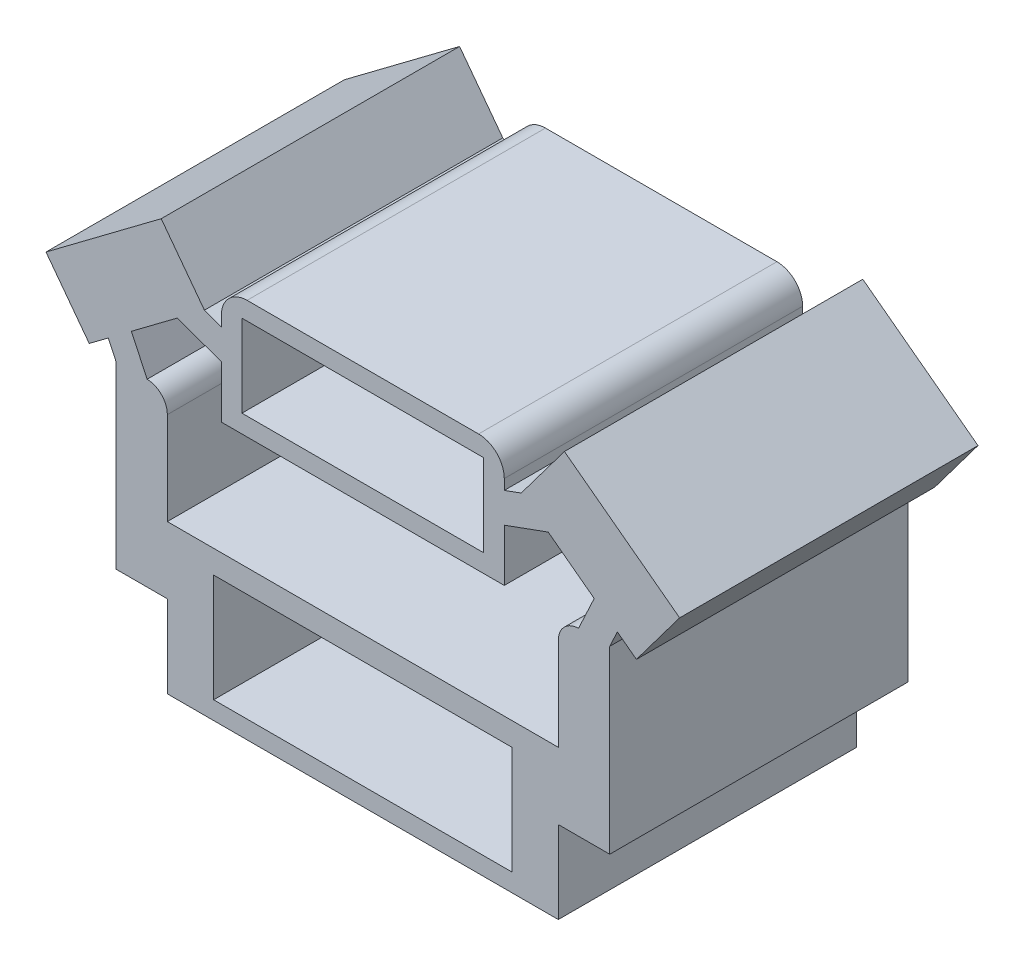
ISO-10303-21;
HEADER;
FILE_DESCRIPTION(('STEP AP214'),'2;1');
FILE_NAME('part.step','',(''),(''),'','','');
FILE_SCHEMA(('AUTOMOTIVE_DESIGN { 1 0 10303 214 1 1 1 1 }'));
ENDSEC;
DATA;
#1=APPLICATION_CONTEXT('core data for automotive mechanical design processes');
#2=APPLICATION_PROTOCOL_DEFINITION('international standard','automotive_design',2000,#1);
#3=PRODUCT_CONTEXT('',#1,'mechanical');
#4=PRODUCT('Part','Part','',(#3));
#5=PRODUCT_RELATED_PRODUCT_CATEGORY('part','',(#4));
#6=PRODUCT_DEFINITION_FORMATION('','',#4);
#7=PRODUCT_DEFINITION_CONTEXT('part definition',#1,'design');
#8=PRODUCT_DEFINITION('design','',#6,#7);
#9=PRODUCT_DEFINITION_SHAPE('','',#8);
#10=(LENGTH_UNIT() NAMED_UNIT(*) SI_UNIT(.MILLI.,.METRE.));
#11=(NAMED_UNIT(*) PLANE_ANGLE_UNIT() SI_UNIT($,.RADIAN.));
#12=(NAMED_UNIT(*) SI_UNIT($,.STERADIAN.) SOLID_ANGLE_UNIT());
#13=UNCERTAINTY_MEASURE_WITH_UNIT(LENGTH_MEASURE(1.E-05),#10,'distance_accuracy_value','');
#14=(GEOMETRIC_REPRESENTATION_CONTEXT(3) GLOBAL_UNCERTAINTY_ASSIGNED_CONTEXT((#13)) GLOBAL_UNIT_ASSIGNED_CONTEXT((#10,
#11,#12)) REPRESENTATION_CONTEXT('',''));
#15=CARTESIAN_POINT('',(0.,0.,0.));
#16=DIRECTION('',(0.,0.,1.));
#17=DIRECTION('',(1.,0.,0.));
#18=AXIS2_PLACEMENT_3D('',#15,#16,#17);
#19=CARTESIAN_POINT('',(32.3,-7.93092497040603,27.55));
#20=DIRECTION('',(1.,0.,0.));
#21=DIRECTION('',(0.,0.,-1.));
#22=AXIS2_PLACEMENT_3D('',#19,#20,#21);
#23=PLANE('',#22);
#24=DIRECTION('',(0.,-1.,0.));
#25=VECTOR('',#24,1.);
#26=CARTESIAN_POINT('',(32.3,-7.93092497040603,27.55));
#27=LINE('',#26,#25);
#28=CARTESIAN_POINT('',(32.3,7.36957476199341,27.55));
#29=VERTEX_POINT('',#28);
#30=CARTESIAN_POINT('',(32.3,-7.93092497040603,27.55));
#31=VERTEX_POINT('',#30);
#32=EDGE_CURVE('E529',#29,#31,#27,.T.);
#33=ORIENTED_EDGE('',*,*,#32,.F.);
#34=DIRECTION('',(0.,0.,1.));
#35=VECTOR('',#34,1.);
#36=CARTESIAN_POINT('',(32.3,7.36957476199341,27.55));
#37=LINE('',#36,#35);
#38=CARTESIAN_POINT('',(32.3,7.36957476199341,-21.75));
#39=VERTEX_POINT('',#38);
#40=EDGE_CURVE('E11',#29,#39,#37,.F.);
#41=ORIENTED_EDGE('',*,*,#40,.T.);
#42=DIRECTION('',(0.,-1.,0.));
#43=VECTOR('',#42,1.);
#44=CARTESIAN_POINT('',(32.3,-7.93092497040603,-21.75));
#45=LINE('',#44,#43);
#46=CARTESIAN_POINT('',(32.3,-7.93092497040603,-21.75));
#47=VERTEX_POINT('',#46);
#48=EDGE_CURVE('E528',#39,#47,#45,.T.);
#49=ORIENTED_EDGE('',*,*,#48,.T.);
#50=DIRECTION('',(0.,0.,-1.));
#51=VECTOR('',#50,1.);
#52=CARTESIAN_POINT('',(32.3,-7.93092497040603,27.55));
#53=LINE('',#52,#51);
#54=EDGE_CURVE('E654',#31,#47,#53,.T.);
#55=ORIENTED_EDGE('',*,*,#54,.F.);
#56=EDGE_LOOP('',(#33,#41,#49,#55));
#57=FACE_BOUND('',#56,.T.);
#58=ADVANCED_FACE('F36',(#57),#23,.F.);
#59=CARTESIAN_POINT('',(-32.3,-7.93092497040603,27.55));
#60=DIRECTION('',(0.,-1.,0.));
#61=DIRECTION('',(1.,0.,0.));
#62=AXIS2_PLACEMENT_3D('',#59,#60,#61);
#63=PLANE('',#62);
#64=DIRECTION('',(-1.,0.,0.));
#65=VECTOR('',#64,1.);
#66=CARTESIAN_POINT('',(-32.3,-7.93092497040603,-21.75));
#67=LINE('',#66,#65);
#68=CARTESIAN_POINT('',(-32.3,-7.93092497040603,-21.75));
#69=VERTEX_POINT('',#68);
#70=EDGE_CURVE('E569',#47,#69,#67,.T.);
#71=ORIENTED_EDGE('',*,*,#70,.T.);
#72=DIRECTION('',(0.,0.,-1.));
#73=VECTOR('',#72,1.);
#74=CARTESIAN_POINT('',(-32.3,-7.93092497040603,27.55));
#75=LINE('',#74,#73);
#76=CARTESIAN_POINT('',(-32.3,-7.93092497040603,27.55));
#77=VERTEX_POINT('',#76);
#78=EDGE_CURVE('E651',#77,#69,#75,.T.);
#79=ORIENTED_EDGE('',*,*,#78,.F.);
#80=DIRECTION('',(-1.,0.,0.));
#81=VECTOR('',#80,1.);
#82=CARTESIAN_POINT('',(-32.3,-7.93092497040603,27.55));
#83=LINE('',#82,#81);
#84=EDGE_CURVE('E531',#31,#77,#83,.T.);
#85=ORIENTED_EDGE('',*,*,#84,.F.);
#86=ORIENTED_EDGE('',*,*,#54,.T.);
#87=EDGE_LOOP('',(#71,#79,#85,#86));
#88=FACE_BOUND('',#87,.T.);
#89=ADVANCED_FACE('F698',(#88),#63,.F.);
#90=CARTESIAN_POINT('',(-32.3,-31.730924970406,27.55));
#91=DIRECTION('',(1.,0.,0.));
#92=DIRECTION('',(0.,0.,-1.));
#93=AXIS2_PLACEMENT_3D('',#90,#91,#92);
#94=PLANE('',#93);
#95=DIRECTION('',(0.,-1.,0.));
#96=VECTOR('',#95,1.);
#97=CARTESIAN_POINT('',(-32.3,-31.730924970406,27.55));
#98=LINE('',#97,#96);
#99=CARTESIAN_POINT('',(-32.3,-18.980924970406,27.55));
#100=VERTEX_POINT('',#99);
#101=CARTESIAN_POINT('',(-32.3,-32.580924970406,27.55));
#102=VERTEX_POINT('',#101);
#103=EDGE_CURVE('E535',#100,#102,#98,.T.);
#104=ORIENTED_EDGE('',*,*,#103,.F.);
#105=DIRECTION('',(0.,0.,-1.));
#106=VECTOR('',#105,1.);
#107=CARTESIAN_POINT('',(-32.3,-18.980924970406,27.55));
#108=LINE('',#107,#106);
#109=CARTESIAN_POINT('',(-32.3,-18.980924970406,-21.75));
#110=VERTEX_POINT('',#109);
#111=EDGE_CURVE('E468',#100,#110,#108,.T.);
#112=ORIENTED_EDGE('',*,*,#111,.T.);
#113=DIRECTION('',(0.,-1.,0.));
#114=VECTOR('',#113,1.);
#115=CARTESIAN_POINT('',(-32.3,-31.730924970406,-21.75));
#116=LINE('',#115,#114);
#117=CARTESIAN_POINT('',(-32.3,-32.580924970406,-21.75));
#118=VERTEX_POINT('',#117);
#119=EDGE_CURVE('E572',#110,#118,#116,.T.);
#120=ORIENTED_EDGE('',*,*,#119,.T.);
#121=DIRECTION('',(0.,0.,1.));
#122=VECTOR('',#121,1.);
#123=CARTESIAN_POINT('',(-32.3,-32.580924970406,-86.3555918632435));
#124=LINE('',#123,#122);
#125=EDGE_CURVE('E371',#118,#102,#124,.T.);
#126=ORIENTED_EDGE('',*,*,#125,.T.);
#127=EDGE_LOOP('',(#104,#112,#120,#126));
#128=FACE_BOUND('',#127,.T.);
#129=ADVANCED_FACE('F754',(#128),#94,.F.);
#130=CARTESIAN_POINT('',(32.3,-31.730924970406,27.55));
#131=DIRECTION('',(-1.,0.,0.));
#132=DIRECTION('',(0.,0.,1.));
#133=AXIS2_PLACEMENT_3D('',#130,#131,#132);
#134=PLANE('',#133);
#135=DIRECTION('',(0.,1.,0.));
#136=VECTOR('',#135,1.);
#137=CARTESIAN_POINT('',(32.3,-31.730924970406,-21.75));
#138=LINE('',#137,#136);
#139=CARTESIAN_POINT('',(32.3,-32.580924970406,-21.75));
#140=VERTEX_POINT('',#139);
#141=CARTESIAN_POINT('',(32.3,-18.980924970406,-21.75));
#142=VERTEX_POINT('',#141);
#143=EDGE_CURVE('E574',#140,#142,#138,.T.);
#144=ORIENTED_EDGE('',*,*,#143,.T.);
#145=DIRECTION('',(0.,0.,-1.));
#146=VECTOR('',#145,1.);
#147=CARTESIAN_POINT('',(32.3,-18.980924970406,27.55));
#148=LINE('',#147,#146);
#149=CARTESIAN_POINT('',(32.3,-18.980924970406,27.55));
#150=VERTEX_POINT('',#149);
#151=EDGE_CURVE('E648',#150,#142,#148,.T.);
#152=ORIENTED_EDGE('',*,*,#151,.F.);
#153=DIRECTION('',(0.,1.,0.));
#154=VECTOR('',#153,1.);
#155=CARTESIAN_POINT('',(32.3,-31.730924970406,27.55));
#156=LINE('',#155,#154);
#157=CARTESIAN_POINT('',(32.3,-32.580924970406,27.55));
#158=VERTEX_POINT('',#157);
#159=EDGE_CURVE('E537',#158,#150,#156,.T.);
#160=ORIENTED_EDGE('',*,*,#159,.F.);
#161=DIRECTION('',(0.,0.,1.));
#162=VECTOR('',#161,1.);
#163=CARTESIAN_POINT('',(32.3,-32.580924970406,-86.3555918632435));
#164=LINE('',#163,#162);
#165=EDGE_CURVE('E368',#140,#158,#164,.T.);
#166=ORIENTED_EDGE('',*,*,#165,.F.);
#167=EDGE_LOOP('',(#144,#152,#160,#166));
#168=FACE_BOUND('',#167,.T.);
#169=ADVANCED_FACE('F875',(#168),#134,.F.);
#170=CARTESIAN_POINT('',(32.3,-18.980924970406,27.55));
#171=DIRECTION('',(0.,1.,0.));
#172=DIRECTION('',(0.,0.,1.));
#173=AXIS2_PLACEMENT_3D('',#170,#171,#172);
#174=PLANE('',#173);
#175=DIRECTION('',(1.,0.,0.));
#176=VECTOR('',#175,1.);
#177=CARTESIAN_POINT('',(32.3,-18.980924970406,-21.75));
#178=LINE('',#177,#176);
#179=CARTESIAN_POINT('',(40.8,-18.980924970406,-21.75));
#180=VERTEX_POINT('',#179);
#181=EDGE_CURVE('E576',#142,#180,#178,.T.);
#182=ORIENTED_EDGE('',*,*,#181,.T.);
#183=DIRECTION('',(0.,0.,-1.));
#184=VECTOR('',#183,1.);
#185=CARTESIAN_POINT('',(40.8,-18.980924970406,27.55));
#186=LINE('',#185,#184);
#187=CARTESIAN_POINT('',(40.8,-18.980924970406,27.55));
#188=VERTEX_POINT('',#187);
#189=EDGE_CURVE('E645',#188,#180,#186,.T.);
#190=ORIENTED_EDGE('',*,*,#189,.F.);
#191=DIRECTION('',(1.,0.,0.));
#192=VECTOR('',#191,1.);
#193=CARTESIAN_POINT('',(32.3,-18.980924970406,27.55));
#194=LINE('',#193,#192);
#195=EDGE_CURVE('E539',#150,#188,#194,.T.);
#196=ORIENTED_EDGE('',*,*,#195,.F.);
#197=ORIENTED_EDGE('',*,*,#151,.T.);
#198=EDGE_LOOP('',(#182,#190,#196,#197));
#199=FACE_BOUND('',#198,.T.);
#200=ADVANCED_FACE('F882',(#199),#174,.F.);
#201=CARTESIAN_POINT('',(40.8,10.769075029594,27.55));
#202=DIRECTION('',(-1.,0.,0.));
#203=DIRECTION('',(0.,-1.,0.));
#204=AXIS2_PLACEMENT_3D('',#201,#202,#203);
#205=PLANE('',#204);
#206=DIRECTION('',(0.,1.,0.));
#207=VECTOR('',#206,1.);
#208=CARTESIAN_POINT('',(40.8,10.769075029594,-21.75));
#209=LINE('',#208,#207);
#210=CARTESIAN_POINT('',(40.8,10.769075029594,-21.75));
#211=VERTEX_POINT('',#210);
#212=EDGE_CURVE('E578',#180,#211,#209,.T.);
#213=ORIENTED_EDGE('',*,*,#212,.T.);
#214=DIRECTION('',(0.,0.,-1.));
#215=VECTOR('',#214,1.);
#216=CARTESIAN_POINT('',(40.8,10.769075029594,27.55));
#217=LINE('',#216,#215);
#218=CARTESIAN_POINT('',(40.8,10.769075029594,27.55));
#219=VERTEX_POINT('',#218);
#220=EDGE_CURVE('E642',#219,#211,#217,.T.);
#221=ORIENTED_EDGE('',*,*,#220,.F.);
#222=DIRECTION('',(0.,1.,0.));
#223=VECTOR('',#222,1.);
#224=CARTESIAN_POINT('',(40.8,10.769075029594,27.55));
#225=LINE('',#224,#223);
#226=EDGE_CURVE('E541',#188,#219,#225,.T.);
#227=ORIENTED_EDGE('',*,*,#226,.F.);
#228=ORIENTED_EDGE('',*,*,#189,.T.);
#229=EDGE_LOOP('',(#213,#221,#227,#228));
#230=FACE_BOUND('',#229,.T.);
#231=ADVANCED_FACE('F886',(#230),#205,.F.);
#232=CARTESIAN_POINT('',(40.8,10.769075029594,27.55));
#233=DIRECTION('',(-0.906307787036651,0.422618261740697,0.));
#234=DIRECTION('',(-0.422618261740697,-0.906307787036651,0.));
#235=AXIS2_PLACEMENT_3D('',#232,#233,#234);
#236=PLANE('',#235);
#237=DIRECTION('',(0.422618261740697,0.906307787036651,0.));
#238=VECTOR('',#237,1.);
#239=CARTESIAN_POINT('',(40.8,10.769075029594,-21.75));
#240=LINE('',#239,#238);
#241=CARTESIAN_POINT('',(42.0572893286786,13.465340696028,-21.75));
#242=VERTEX_POINT('',#241);
#243=EDGE_CURVE('E580',#211,#242,#240,.T.);
#244=ORIENTED_EDGE('',*,*,#243,.T.);
#245=DIRECTION('',(0.,0.,-1.));
#246=VECTOR('',#245,1.);
#247=CARTESIAN_POINT('',(42.0572893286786,13.465340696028,27.55));
#248=LINE('',#247,#246);
#249=CARTESIAN_POINT('',(42.0572893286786,13.465340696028,27.55));
#250=VERTEX_POINT('',#249);
#251=EDGE_CURVE('E639',#250,#242,#248,.T.);
#252=ORIENTED_EDGE('',*,*,#251,.F.);
#253=DIRECTION('',(0.422618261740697,0.906307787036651,0.));
#254=VECTOR('',#253,1.);
#255=CARTESIAN_POINT('',(40.8,10.769075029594,27.55));
#256=LINE('',#255,#254);
#257=EDGE_CURVE('E543',#219,#250,#256,.T.);
#258=ORIENTED_EDGE('',*,*,#257,.F.);
#259=ORIENTED_EDGE('',*,*,#220,.T.);
#260=EDGE_LOOP('',(#244,#252,#258,#259));
#261=FACE_BOUND('',#260,.T.);
#262=ADVANCED_FACE('F891',(#261),#236,.F.);
#263=CARTESIAN_POINT('',(42.0572893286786,13.465340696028,27.55));
#264=DIRECTION('',(0.600200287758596,0.799849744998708,0.));
#265=DIRECTION('',(-0.799849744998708,0.600200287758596,0.));
#266=AXIS2_PLACEMENT_3D('',#263,#264,#265);
#267=PLANE('',#266);
#268=DIRECTION('',(0.799849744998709,-0.600200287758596,0.));
#269=VECTOR('',#268,1.);
#270=CARTESIAN_POINT('',(42.0572893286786,13.465340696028,-21.75));
#271=LINE('',#270,#269);
#272=CARTESIAN_POINT('',(45.2070094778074,11.1018181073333,-21.75));
#273=VERTEX_POINT('',#272);
#274=EDGE_CURVE('E582',#242,#273,#271,.T.);
#275=ORIENTED_EDGE('',*,*,#274,.T.);
#276=DIRECTION('',(0.,0.,-1.));
#277=VECTOR('',#276,1.);
#278=CARTESIAN_POINT('',(45.2070094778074,11.1018181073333,27.55));
#279=LINE('',#278,#277);
#280=CARTESIAN_POINT('',(45.2070094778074,11.1018181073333,27.55));
#281=VERTEX_POINT('',#280);
#282=EDGE_CURVE('E636',#281,#273,#279,.T.);
#283=ORIENTED_EDGE('',*,*,#282,.F.);
#284=DIRECTION('',(0.799849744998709,-0.600200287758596,0.));
#285=VECTOR('',#284,1.);
#286=CARTESIAN_POINT('',(42.0572893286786,13.465340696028,27.55));
#287=LINE('',#286,#285);
#288=EDGE_CURVE('E545',#250,#281,#287,.T.);
#289=ORIENTED_EDGE('',*,*,#288,.F.);
#290=ORIENTED_EDGE('',*,*,#251,.T.);
#291=EDGE_LOOP('',(#275,#283,#289,#290));
#292=FACE_BOUND('',#291,.T.);
#293=ADVANCED_FACE('F897',(#292),#267,.F.);
#294=CARTESIAN_POINT('',(45.2070094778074,11.1018181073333,27.55));
#295=DIRECTION('',(-0.79984974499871,0.600200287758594,0.));
#296=DIRECTION('',(-0.600200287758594,-0.79984974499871,0.));
#297=AXIS2_PLACEMENT_3D('',#294,#295,#296);
#298=PLANE('',#297);
#299=DIRECTION('',(0.600200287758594,0.79984974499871,0.));
#300=VECTOR('',#299,1.);
#301=CARTESIAN_POINT('',(45.2070094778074,11.1018181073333,-21.75));
#302=LINE('',#301,#300);
#303=CARTESIAN_POINT('',(52.3493929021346,20.620030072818,-21.75));
#304=VERTEX_POINT('',#303);
#305=EDGE_CURVE('E584',#273,#304,#302,.T.);
#306=ORIENTED_EDGE('',*,*,#305,.T.);
#307=DIRECTION('',(0.,0.,-1.));
#308=VECTOR('',#307,1.);
#309=CARTESIAN_POINT('',(52.3493929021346,20.620030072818,27.55));
#310=LINE('',#309,#308);
#311=CARTESIAN_POINT('',(52.3493929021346,20.620030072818,27.55));
#312=VERTEX_POINT('',#311);
#313=EDGE_CURVE('E633',#312,#304,#310,.T.);
#314=ORIENTED_EDGE('',*,*,#313,.F.);
#315=DIRECTION('',(0.600200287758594,0.79984974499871,0.));
#316=VECTOR('',#315,1.);
#317=CARTESIAN_POINT('',(45.2070094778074,11.1018181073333,27.55));
#318=LINE('',#317,#316);
#319=EDGE_CURVE('E547',#281,#312,#318,.T.);
#320=ORIENTED_EDGE('',*,*,#319,.F.);
#321=ORIENTED_EDGE('',*,*,#282,.T.);
#322=EDGE_LOOP('',(#306,#314,#320,#321));
#323=FACE_BOUND('',#322,.T.);
#324=ADVANCED_FACE('F901',(#323),#298,.F.);
#325=CARTESIAN_POINT('',(33.3129689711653,34.9047969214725,27.55));
#326=DIRECTION('',(-0.600200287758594,-0.79984974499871,0.));
#327=DIRECTION('',(0.79984974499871,-0.600200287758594,0.));
#328=AXIS2_PLACEMENT_3D('',#325,#326,#327);
#329=PLANE('',#328);
#330=DIRECTION('',(-0.79984974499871,0.600200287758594,0.));
#331=VECTOR('',#330,1.);
#332=CARTESIAN_POINT('',(33.3129689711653,34.9047969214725,-21.75));
#333=LINE('',#332,#331);
#334=CARTESIAN_POINT('',(33.3129689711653,34.9047969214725,-21.75));
#335=VERTEX_POINT('',#334);
#336=EDGE_CURVE('E586',#304,#335,#333,.T.);
#337=ORIENTED_EDGE('',*,*,#336,.T.);
#338=DIRECTION('',(0.,0.,-1.));
#339=VECTOR('',#338,1.);
#340=CARTESIAN_POINT('',(33.3129689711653,34.9047969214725,27.55));
#341=LINE('',#340,#339);
#342=CARTESIAN_POINT('',(33.3129689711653,34.9047969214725,27.55));
#343=VERTEX_POINT('',#342);
#344=EDGE_CURVE('E630',#343,#335,#341,.T.);
#345=ORIENTED_EDGE('',*,*,#344,.F.);
#346=DIRECTION('',(-0.79984974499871,0.600200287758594,0.));
#347=VECTOR('',#346,1.);
#348=CARTESIAN_POINT('',(33.3129689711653,34.9047969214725,27.55));
#349=LINE('',#348,#347);
#350=EDGE_CURVE('E549',#312,#343,#349,.T.);
#351=ORIENTED_EDGE('',*,*,#350,.F.);
#352=ORIENTED_EDGE('',*,*,#313,.T.);
#353=EDGE_LOOP('',(#337,#345,#351,#352));
#354=FACE_BOUND('',#353,.T.);
#355=ADVANCED_FACE('F906',(#354),#329,.F.);
#356=CARTESIAN_POINT('',(33.3129689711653,34.9047969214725,27.55));
#357=DIRECTION('',(0.79984974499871,-0.600200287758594,0.));
#358=DIRECTION('',(0.600200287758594,0.79984974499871,0.));
#359=AXIS2_PLACEMENT_3D('',#356,#357,#358);
#360=PLANE('',#359);
#361=DIRECTION('',(-0.600200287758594,-0.79984974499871,0.));
#362=VECTOR('',#361,1.);
#363=CARTESIAN_POINT('',(33.3129689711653,34.9047969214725,-21.75));
#364=LINE('',#363,#362);
#365=CARTESIAN_POINT('',(26.1705855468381,25.3865849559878,-21.75));
#366=VERTEX_POINT('',#365);
#367=EDGE_CURVE('E588',#335,#366,#364,.T.);
#368=ORIENTED_EDGE('',*,*,#367,.T.);
#369=DIRECTION('',(0.,0.,-1.));
#370=VECTOR('',#369,1.);
#371=CARTESIAN_POINT('',(26.1705855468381,25.3865849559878,27.55));
#372=LINE('',#371,#370);
#373=CARTESIAN_POINT('',(26.1705855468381,25.3865849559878,27.55));
#374=VERTEX_POINT('',#373);
#375=EDGE_CURVE('E627',#374,#366,#372,.T.);
#376=ORIENTED_EDGE('',*,*,#375,.F.);
#377=DIRECTION('',(-0.600200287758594,-0.79984974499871,0.));
#378=VECTOR('',#377,1.);
#379=CARTESIAN_POINT('',(33.3129689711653,34.9047969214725,27.55));
#380=LINE('',#379,#378);
#381=EDGE_CURVE('E551',#343,#374,#380,.T.);
#382=ORIENTED_EDGE('',*,*,#381,.F.);
#383=ORIENTED_EDGE('',*,*,#344,.T.);
#384=EDGE_LOOP('',(#368,#376,#382,#383));
#385=FACE_BOUND('',#384,.T.);
#386=ADVANCED_FACE('F912',(#385),#360,.F.);
#387=CARTESIAN_POINT('',(23.375,24.369075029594,27.55));
#388=DIRECTION('',(0.342020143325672,-0.939692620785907,0.));
#389=DIRECTION('',(0.939692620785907,0.342020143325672,0.));
#390=AXIS2_PLACEMENT_3D('',#387,#388,#389);
#391=PLANE('',#390);
#392=DIRECTION('',(-0.939692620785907,-0.342020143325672,0.));
#393=VECTOR('',#392,1.);
#394=CARTESIAN_POINT('',(23.375,24.369075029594,-21.75));
#395=LINE('',#394,#393);
#396=CARTESIAN_POINT('',(23.375,24.369075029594,-21.75));
#397=VERTEX_POINT('',#396);
#398=EDGE_CURVE('E590',#366,#397,#395,.T.);
#399=ORIENTED_EDGE('',*,*,#398,.T.);
#400=DIRECTION('',(0.,0.,-1.));
#401=VECTOR('',#400,1.);
#402=CARTESIAN_POINT('',(23.375,24.369075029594,27.55));
#403=LINE('',#402,#401);
#404=CARTESIAN_POINT('',(23.375,24.369075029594,27.55));
#405=VERTEX_POINT('',#404);
#406=EDGE_CURVE('E624',#405,#397,#403,.T.);
#407=ORIENTED_EDGE('',*,*,#406,.F.);
#408=DIRECTION('',(-0.939692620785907,-0.342020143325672,0.));
#409=VECTOR('',#408,1.);
#410=CARTESIAN_POINT('',(23.375,24.369075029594,27.55));
#411=LINE('',#410,#409);
#412=EDGE_CURVE('E553',#374,#405,#411,.T.);
#413=ORIENTED_EDGE('',*,*,#412,.F.);
#414=ORIENTED_EDGE('',*,*,#375,.T.);
#415=EDGE_LOOP('',(#399,#407,#413,#414));
#416=FACE_BOUND('',#415,.T.);
#417=ADVANCED_FACE('F916',(#416),#391,.F.);
#418=CARTESIAN_POINT('',(-23.375,24.369075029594,27.55));
#419=DIRECTION('',(1.,0.,0.));
#420=DIRECTION('',(0.,0.,-1.));
#421=AXIS2_PLACEMENT_3D('',#418,#419,#420);
#422=PLANE('',#421);
#423=DIRECTION('',(0.,-1.,0.));
#424=VECTOR('',#423,1.);
#425=CARTESIAN_POINT('',(-23.375,24.369075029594,27.55));
#426=LINE('',#425,#424);
#427=CARTESIAN_POINT('',(-23.375,19.3940439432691,27.55));
#428=VERTEX_POINT('',#427);
#429=CARTESIAN_POINT('',(-23.375,10.769075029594,27.55));
#430=VERTEX_POINT('',#429);
#431=EDGE_CURVE('E555',#428,#430,#426,.T.);
#432=ORIENTED_EDGE('',*,*,#431,.F.);
#433=DIRECTION('',(0.,0.,-1.));
#434=VECTOR('',#433,1.);
#435=CARTESIAN_POINT('',(-23.375,19.3940439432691,27.55));
#436=LINE('',#435,#434);
#437=CARTESIAN_POINT('',(-23.375,19.3940439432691,-21.75));
#438=VERTEX_POINT('',#437);
#439=EDGE_CURVE('E518',#428,#438,#436,.T.);
#440=ORIENTED_EDGE('',*,*,#439,.T.);
#441=DIRECTION('',(0.,-1.,0.));
#442=VECTOR('',#441,1.);
#443=CARTESIAN_POINT('',(-23.375,24.369075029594,-21.75));
#444=LINE('',#443,#442);
#445=CARTESIAN_POINT('',(-23.375,10.769075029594,-21.75));
#446=VERTEX_POINT('',#445);
#447=EDGE_CURVE('E592',#438,#446,#444,.T.);
#448=ORIENTED_EDGE('',*,*,#447,.T.);
#449=DIRECTION('',(0.,0.,-1.));
#450=VECTOR('',#449,1.);
#451=CARTESIAN_POINT('',(-23.375,10.769075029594,27.55));
#452=LINE('',#451,#450);
#453=EDGE_CURVE('E618',#430,#446,#452,.T.);
#454=ORIENTED_EDGE('',*,*,#453,.F.);
#455=EDGE_LOOP('',(#432,#440,#448,#454));
#456=FACE_BOUND('',#455,.T.);
#457=ADVANCED_FACE('F731',(#456),#422,.F.);
#458=CARTESIAN_POINT('',(-23.375,10.769075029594,27.55));
#459=DIRECTION('',(0.,1.,0.));
#460=DIRECTION('',(0.,0.,1.));
#461=AXIS2_PLACEMENT_3D('',#458,#459,#460);
#462=PLANE('',#461);
#463=DIRECTION('',(1.,0.,0.));
#464=VECTOR('',#463,1.);
#465=CARTESIAN_POINT('',(-23.375,10.769075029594,-21.75));
#466=LINE('',#465,#464);
#467=CARTESIAN_POINT('',(23.375,10.769075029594,-21.75));
#468=VERTEX_POINT('',#467);
#469=EDGE_CURVE('E594',#446,#468,#466,.T.);
#470=ORIENTED_EDGE('',*,*,#469,.T.);
#471=DIRECTION('',(0.,0.,-1.));
#472=VECTOR('',#471,1.);
#473=CARTESIAN_POINT('',(23.375,10.769075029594,27.55));
#474=LINE('',#473,#472);
#475=CARTESIAN_POINT('',(23.375,10.769075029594,27.55));
#476=VERTEX_POINT('',#475);
#477=EDGE_CURVE('E615',#476,#468,#474,.T.);
#478=ORIENTED_EDGE('',*,*,#477,.F.);
#479=DIRECTION('',(1.,0.,0.));
#480=VECTOR('',#479,1.);
#481=CARTESIAN_POINT('',(-23.375,10.769075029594,27.55));
#482=LINE('',#481,#480);
#483=EDGE_CURVE('E557',#430,#476,#482,.T.);
#484=ORIENTED_EDGE('',*,*,#483,.F.);
#485=ORIENTED_EDGE('',*,*,#453,.T.);
#486=EDGE_LOOP('',(#470,#478,#484,#485));
#487=FACE_BOUND('',#486,.T.);
#488=ADVANCED_FACE('F727',(#487),#462,.F.);
#489=CARTESIAN_POINT('',(23.375,19.3940439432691,27.55));
#490=DIRECTION('',(-1.,0.,0.));
#491=DIRECTION('',(0.,0.,1.));
#492=AXIS2_PLACEMENT_3D('',#489,#490,#491);
#493=PLANE('',#492);
#494=DIRECTION('',(0.,1.,0.));
#495=VECTOR('',#494,1.);
#496=CARTESIAN_POINT('',(23.375,19.3940439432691,-21.75));
#497=LINE('',#496,#495);
#498=CARTESIAN_POINT('',(23.375,19.3940439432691,-21.75));
#499=VERTEX_POINT('',#498);
#500=EDGE_CURVE('E596',#468,#499,#497,.T.);
#501=ORIENTED_EDGE('',*,*,#500,.T.);
#502=DIRECTION('',(0.,0.,-1.));
#503=VECTOR('',#502,1.);
#504=CARTESIAN_POINT('',(23.375,19.3940439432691,27.55));
#505=LINE('',#504,#503);
#506=CARTESIAN_POINT('',(23.375,19.3940439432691,27.55));
#507=VERTEX_POINT('',#506);
#508=EDGE_CURVE('E612',#507,#499,#505,.T.);
#509=ORIENTED_EDGE('',*,*,#508,.F.);
#510=DIRECTION('',(0.,1.,0.));
#511=VECTOR('',#510,1.);
#512=CARTESIAN_POINT('',(23.375,19.3940439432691,27.55));
#513=LINE('',#512,#511);
#514=EDGE_CURVE('E559',#476,#507,#513,.T.);
#515=ORIENTED_EDGE('',*,*,#514,.F.);
#516=ORIENTED_EDGE('',*,*,#477,.T.);
#517=EDGE_LOOP('',(#501,#509,#515,#516));
#518=FACE_BOUND('',#517,.T.);
#519=ADVANCED_FACE('F723',(#518),#493,.F.);
#520=CARTESIAN_POINT('',(23.375,19.3940439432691,27.55));
#521=DIRECTION('',(-0.342020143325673,0.939692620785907,0.));
#522=DIRECTION('',(-0.939692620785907,-0.342020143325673,0.));
#523=AXIS2_PLACEMENT_3D('',#520,#521,#522);
#524=PLANE('',#523);
#525=DIRECTION('',(0.939692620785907,0.342020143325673,0.));
#526=VECTOR('',#525,1.);
#527=CARTESIAN_POINT('',(23.375,19.3940439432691,-21.75));
#528=LINE('',#527,#526);
#529=CARTESIAN_POINT('',(30.6350532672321,22.0364872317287,-21.75));
#530=VERTEX_POINT('',#529);
#531=EDGE_CURVE('E598',#499,#530,#528,.T.);
#532=ORIENTED_EDGE('',*,*,#531,.T.);
#533=DIRECTION('',(0.,0.,-1.));
#534=VECTOR('',#533,1.);
#535=CARTESIAN_POINT('',(30.6350532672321,22.0364872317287,27.55));
#536=LINE('',#535,#534);
#537=CARTESIAN_POINT('',(30.6350532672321,22.0364872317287,27.55));
#538=VERTEX_POINT('',#537);
#539=EDGE_CURVE('E609',#538,#530,#536,.T.);
#540=ORIENTED_EDGE('',*,*,#539,.F.);
#541=DIRECTION('',(0.939692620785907,0.342020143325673,0.));
#542=VECTOR('',#541,1.);
#543=CARTESIAN_POINT('',(23.375,19.3940439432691,27.55));
#544=LINE('',#543,#542);
#545=EDGE_CURVE('E561',#507,#538,#544,.T.);
#546=ORIENTED_EDGE('',*,*,#545,.F.);
#547=ORIENTED_EDGE('',*,*,#508,.T.);
#548=EDGE_LOOP('',(#532,#540,#546,#547));
#549=FACE_BOUND('',#548,.T.);
#550=ADVANCED_FACE('F719',(#549),#524,.F.);
#551=CARTESIAN_POINT('',(30.6350532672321,22.0364872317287,27.55));
#552=DIRECTION('',(0.600200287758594,0.79984974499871,0.));
#553=DIRECTION('',(-0.79984974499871,0.600200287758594,0.));
#554=AXIS2_PLACEMENT_3D('',#551,#552,#553);
#555=PLANE('',#554);
#556=DIRECTION('',(0.79984974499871,-0.600200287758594,0.));
#557=VECTOR('',#556,1.);
#558=CARTESIAN_POINT('',(30.6350532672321,22.0364872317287,-21.75));
#559=LINE('',#558,#557);
#560=CARTESIAN_POINT('',(38.2360867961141,16.3327378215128,-21.75));
#561=VERTEX_POINT('',#560);
#562=EDGE_CURVE('E600',#530,#561,#559,.T.);
#563=ORIENTED_EDGE('',*,*,#562,.T.);
#564=DIRECTION('',(0.,0.,-1.));
#565=VECTOR('',#564,1.);
#566=CARTESIAN_POINT('',(38.2360867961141,16.3327378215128,27.55));
#567=LINE('',#566,#565);
#568=CARTESIAN_POINT('',(38.2360867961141,16.3327378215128,27.55));
#569=VERTEX_POINT('',#568);
#570=EDGE_CURVE('E606',#569,#561,#567,.T.);
#571=ORIENTED_EDGE('',*,*,#570,.F.);
#572=DIRECTION('',(0.79984974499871,-0.600200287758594,0.));
#573=VECTOR('',#572,1.);
#574=CARTESIAN_POINT('',(30.6350532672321,22.0364872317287,27.55));
#575=LINE('',#574,#573);
#576=EDGE_CURVE('E563',#538,#569,#575,.T.);
#577=ORIENTED_EDGE('',*,*,#576,.F.);
#578=ORIENTED_EDGE('',*,*,#539,.T.);
#579=EDGE_LOOP('',(#563,#571,#577,#578));
#580=FACE_BOUND('',#579,.T.);
#581=ADVANCED_FACE('F714',(#580),#555,.F.);
#582=CARTESIAN_POINT('',(35.6417082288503,10.769075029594,27.55));
#583=DIRECTION('',(0.906307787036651,-0.422618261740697,0.));
#584=DIRECTION('',(0.422618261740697,0.906307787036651,0.));
#585=AXIS2_PLACEMENT_3D('',#582,#583,#584);
#586=PLANE('',#585);
#587=DIRECTION('',(-0.422618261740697,-0.906307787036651,0.));
#588=VECTOR('',#587,1.);
#589=CARTESIAN_POINT('',(35.6417082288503,10.769075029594,-21.75));
#590=LINE('',#589,#588);
#591=CARTESIAN_POINT('',(35.6417082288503,10.769075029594,-21.75));
#592=VERTEX_POINT('',#591);
#593=EDGE_CURVE('E532',#561,#592,#590,.T.);
#594=ORIENTED_EDGE('',*,*,#593,.T.);
#595=DIRECTION('',(0.,0.,-1.));
#596=VECTOR('',#595,1.);
#597=CARTESIAN_POINT('',(35.6417082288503,10.769075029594,27.55));
#598=LINE('',#597,#596);
#599=CARTESIAN_POINT('',(35.6417082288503,10.769075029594,27.55));
#600=VERTEX_POINT('',#599);
#601=EDGE_CURVE('E567',#600,#592,#598,.T.);
#602=ORIENTED_EDGE('',*,*,#601,.F.);
#603=DIRECTION('',(-0.422618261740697,-0.906307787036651,0.));
#604=VECTOR('',#603,1.);
#605=CARTESIAN_POINT('',(35.6417082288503,10.769075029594,27.55));
#606=LINE('',#605,#604);
#607=EDGE_CURVE('E565',#569,#600,#606,.T.);
#608=ORIENTED_EDGE('',*,*,#607,.F.);
#609=ORIENTED_EDGE('',*,*,#570,.T.);
#610=EDGE_LOOP('',(#594,#602,#608,#609));
#611=FACE_BOUND('',#610,.T.);
#612=ADVANCED_FACE('F708',(#611),#586,.F.);
#613=CARTESIAN_POINT('',(0.,-19.830924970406,27.55));
#614=DIRECTION('',(0.,0.,-1.));
#615=DIRECTION('',(-1.,0.,0.));
#616=AXIS2_PLACEMENT_3D('',#613,#614,#615);
#617=PLANE('',#616);
#618=DIRECTION('',(1.,0.,0.));
#619=VECTOR('',#618,1.);
#620=CARTESIAN_POINT('',(-24.65,-29.605924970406,27.55));
#621=LINE('',#620,#619);
#622=CARTESIAN_POINT('',(-24.65,-29.605924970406,27.55));
#623=VERTEX_POINT('',#622);
#624=CARTESIAN_POINT('',(24.65,-29.605924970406,27.55));
#625=VERTEX_POINT('',#624);
#626=EDGE_CURVE('E357',#623,#625,#621,.T.);
#627=ORIENTED_EDGE('',*,*,#626,.F.);
#628=DIRECTION('',(0.,-1.,0.));
#629=VECTOR('',#628,1.);
#630=CARTESIAN_POINT('',(-24.65,-28.755924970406,27.55));
#631=LINE('',#630,#629);
#632=CARTESIAN_POINT('',(-24.65,-11.755924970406,27.55));
#633=VERTEX_POINT('',#632);
#634=EDGE_CURVE('E348',#633,#623,#631,.T.);
#635=ORIENTED_EDGE('',*,*,#634,.F.);
#636=DIRECTION('',(1.,0.,0.));
#637=VECTOR('',#636,1.);
#638=CARTESIAN_POINT('',(-24.65,-11.755924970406,27.55));
#639=LINE('',#638,#637);
#640=CARTESIAN_POINT('',(24.65,-11.755924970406,27.55));
#641=VERTEX_POINT('',#640);
#642=EDGE_CURVE('E374',#633,#641,#639,.T.);
#643=ORIENTED_EDGE('',*,*,#642,.T.);
#644=DIRECTION('',(0.,1.,0.));
#645=VECTOR('',#644,1.);
#646=CARTESIAN_POINT('',(24.65,-28.755924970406,27.55));
#647=LINE('',#646,#645);
#648=EDGE_CURVE('E413',#625,#641,#647,.T.);
#649=ORIENTED_EDGE('',*,*,#648,.F.);
#650=EDGE_LOOP('',(#627,#635,#643,#649));
#651=FACE_BOUND('',#650,.T.);
#652=DIRECTION('',(1.,0.,0.));
#653=VECTOR('',#652,1.);
#654=CARTESIAN_POINT('',(19.975,27.344075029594,27.55));
#655=LINE('',#654,#653);
#656=CARTESIAN_POINT('',(-19.975,27.344075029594,27.55));
#657=VERTEX_POINT('',#656);
#658=CARTESIAN_POINT('',(19.975,27.344075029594,27.55));
#659=VERTEX_POINT('',#658);
#660=EDGE_CURVE('E383',#657,#659,#655,.T.);
#661=ORIENTED_EDGE('',*,*,#660,.T.);
#662=DIRECTION('',(0.,1.,0.));
#663=VECTOR('',#662,1.);
#664=CARTESIAN_POINT('',(19.975,27.344075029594,27.55));
#665=LINE('',#664,#663);
#666=CARTESIAN_POINT('',(19.975,13.744075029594,27.55));
#667=VERTEX_POINT('',#666);
#668=EDGE_CURVE('E421',#667,#659,#665,.T.);
#669=ORIENTED_EDGE('',*,*,#668,.F.);
#670=DIRECTION('',(1.,0.,0.));
#671=VECTOR('',#670,1.);
#672=CARTESIAN_POINT('',(-19.975,13.744075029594,27.55));
#673=LINE('',#672,#671);
#674=CARTESIAN_POINT('',(-19.975,13.744075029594,27.55));
#675=VERTEX_POINT('',#674);
#676=EDGE_CURVE('E425',#675,#667,#673,.T.);
#677=ORIENTED_EDGE('',*,*,#676,.F.);
#678=DIRECTION('',(0.,-1.,0.));
#679=VECTOR('',#678,1.);
#680=CARTESIAN_POINT('',(-19.975,27.3440750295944,27.55));
#681=LINE('',#680,#679);
#682=EDGE_CURVE('E411',#657,#675,#681,.T.);
#683=ORIENTED_EDGE('',*,*,#682,.F.);
#684=EDGE_LOOP('',(#661,#669,#677,#683));
#685=FACE_BOUND('',#684,.T.);
#686=DIRECTION('',(-1.,0.,0.));
#687=VECTOR('',#686,1.);
#688=CARTESIAN_POINT('',(-23.375,30.319075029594,27.55));
#689=LINE('',#688,#687);
#690=CARTESIAN_POINT('',(19.125,30.319075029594,27.55));
#691=VERTEX_POINT('',#690);
#692=CARTESIAN_POINT('',(-19.125,30.319075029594,27.55));
#693=VERTEX_POINT('',#692);
#694=EDGE_CURVE('E387',#691,#693,#689,.T.);
#695=ORIENTED_EDGE('',*,*,#694,.T.);
#696=CARTESIAN_POINT('',(-19.125,26.069075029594,27.55));
#697=DIRECTION('',(0.,0.,-1.));
#698=DIRECTION('',(-1.,0.,0.));
#699=AXIS2_PLACEMENT_3D('',#696,#697,#698);
#700=CIRCLE('',#699,4.25);
#701=CARTESIAN_POINT('',(-23.375,26.069075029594,27.55));
#702=VERTEX_POINT('',#701);
#703=EDGE_CURVE('E666',#693,#702,#700,.F.);
#704=ORIENTED_EDGE('',*,*,#703,.T.);
#705=DIRECTION('',(0.,-1.,0.));
#706=VECTOR('',#705,1.);
#707=CARTESIAN_POINT('',(-23.375,24.369075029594,27.55));
#708=LINE('',#707,#706);
#709=CARTESIAN_POINT('',(-23.375,24.369075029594,27.55));
#710=VERTEX_POINT('',#709);
#711=EDGE_CURVE('E384',#702,#710,#708,.T.);
#712=ORIENTED_EDGE('',*,*,#711,.T.);
#713=DIRECTION('',(0.939692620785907,-0.342020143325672,0.));
#714=VECTOR('',#713,1.);
#715=CARTESIAN_POINT('',(-23.375,24.369075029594,27.55));
#716=LINE('',#715,#714);
#717=CARTESIAN_POINT('',(-26.1705855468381,25.3865849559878,27.55));
#718=VERTEX_POINT('',#717);
#719=EDGE_CURVE('E444',#718,#710,#716,.T.);
#720=ORIENTED_EDGE('',*,*,#719,.F.);
#721=DIRECTION('',(0.600200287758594,-0.79984974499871,0.));
#722=VECTOR('',#721,1.);
#723=CARTESIAN_POINT('',(-33.3129689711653,34.9047969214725,27.55));
#724=LINE('',#723,#722);
#725=CARTESIAN_POINT('',(-33.3129689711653,34.9047969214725,27.55));
#726=VERTEX_POINT('',#725);
#727=EDGE_CURVE('E447',#726,#718,#724,.T.);
#728=ORIENTED_EDGE('',*,*,#727,.F.);
#729=DIRECTION('',(0.79984974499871,0.600200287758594,0.));
#730=VECTOR('',#729,1.);
#731=CARTESIAN_POINT('',(-33.3129689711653,34.9047969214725,27.55));
#732=LINE('',#731,#730);
#733=CARTESIAN_POINT('',(-52.3493929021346,20.620030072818,27.55));
#734=VERTEX_POINT('',#733);
#735=EDGE_CURVE('E450',#734,#726,#732,.T.);
#736=ORIENTED_EDGE('',*,*,#735,.F.);
#737=DIRECTION('',(-0.600200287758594,0.79984974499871,0.));
#738=VECTOR('',#737,1.);
#739=CARTESIAN_POINT('',(-45.2070094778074,11.1018181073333,27.55));
#740=LINE('',#739,#738);
#741=CARTESIAN_POINT('',(-45.2070094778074,11.1018181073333,27.55));
#742=VERTEX_POINT('',#741);
#743=EDGE_CURVE('E453',#742,#734,#740,.T.);
#744=ORIENTED_EDGE('',*,*,#743,.F.);
#745=DIRECTION('',(-0.799849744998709,-0.600200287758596,0.));
#746=VECTOR('',#745,1.);
#747=CARTESIAN_POINT('',(-42.0572893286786,13.465340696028,27.55));
#748=LINE('',#747,#746);
#749=CARTESIAN_POINT('',(-42.0572893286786,13.465340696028,27.55));
#750=VERTEX_POINT('',#749);
#751=EDGE_CURVE('E456',#750,#742,#748,.T.);
#752=ORIENTED_EDGE('',*,*,#751,.F.);
#753=DIRECTION('',(-0.422618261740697,0.906307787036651,0.));
#754=VECTOR('',#753,1.);
#755=CARTESIAN_POINT('',(-40.8,10.769075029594,27.55));
#756=LINE('',#755,#754);
#757=CARTESIAN_POINT('',(-40.8,10.769075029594,27.55));
#758=VERTEX_POINT('',#757);
#759=EDGE_CURVE('E459',#758,#750,#756,.T.);
#760=ORIENTED_EDGE('',*,*,#759,.F.);
#761=DIRECTION('',(0.,1.,0.));
#762=VECTOR('',#761,1.);
#763=CARTESIAN_POINT('',(-40.8,10.769075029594,27.55));
#764=LINE('',#763,#762);
#765=CARTESIAN_POINT('',(-40.8,-18.980924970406,27.55));
#766=VERTEX_POINT('',#765);
#767=EDGE_CURVE('E462',#766,#758,#764,.T.);
#768=ORIENTED_EDGE('',*,*,#767,.F.);
#769=DIRECTION('',(-1.,0.,0.));
#770=VECTOR('',#769,1.);
#771=CARTESIAN_POINT('',(-32.3,-18.980924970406,27.55));
#772=LINE('',#771,#770);
#773=EDGE_CURVE('E465',#100,#766,#772,.T.);
#774=ORIENTED_EDGE('',*,*,#773,.F.);
#775=ORIENTED_EDGE('',*,*,#103,.T.);
#776=DIRECTION('',(1.,0.,0.));
#777=VECTOR('',#776,1.);
#778=CARTESIAN_POINT('',(-32.3,-32.580924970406,27.55));
#779=LINE('',#778,#777);
#780=EDGE_CURVE('E361',#102,#158,#779,.T.);
#781=ORIENTED_EDGE('',*,*,#780,.T.);
#782=ORIENTED_EDGE('',*,*,#159,.T.);
#783=ORIENTED_EDGE('',*,*,#195,.T.);
#784=ORIENTED_EDGE('',*,*,#226,.T.);
#785=ORIENTED_EDGE('',*,*,#257,.T.);
#786=ORIENTED_EDGE('',*,*,#288,.T.);
#787=ORIENTED_EDGE('',*,*,#319,.T.);
#788=ORIENTED_EDGE('',*,*,#350,.T.);
#789=ORIENTED_EDGE('',*,*,#381,.T.);
#790=ORIENTED_EDGE('',*,*,#412,.T.);
#791=DIRECTION('',(0.,1.,0.));
#792=VECTOR('',#791,1.);
#793=CARTESIAN_POINT('',(23.375,30.319075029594,27.55));
#794=LINE('',#793,#792);
#795=CARTESIAN_POINT('',(23.375,26.069075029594,27.55));
#796=VERTEX_POINT('',#795);
#797=EDGE_CURVE('E390',#405,#796,#794,.T.);
#798=ORIENTED_EDGE('',*,*,#797,.T.);
#799=CARTESIAN_POINT('',(19.125,26.069075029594,27.55));
#800=DIRECTION('',(0.,0.,-1.));
#801=DIRECTION('',(-1.,0.,0.));
#802=AXIS2_PLACEMENT_3D('',#799,#800,#801);
#803=CIRCLE('',#802,4.25);
#804=EDGE_CURVE('E664',#796,#691,#803,.F.);
#805=ORIENTED_EDGE('',*,*,#804,.T.);
#806=EDGE_LOOP('',(#695,#704,#712,#720,#728,#736,#744,#752,#760,#768,#774,#775,#781,#782,#783,
#784,#785,#786,#787,#788,#789,#790,#798,#805));
#807=FACE_BOUND('',#806,.T.);
#808=DIRECTION('',(0.,-1.,0.));
#809=VECTOR('',#808,1.);
#810=CARTESIAN_POINT('',(-32.3,-7.93092497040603,27.55));
#811=LINE('',#810,#809);
#812=CARTESIAN_POINT('',(-32.3,7.36957476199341,27.55));
#813=VERTEX_POINT('',#812);
#814=EDGE_CURVE('E432',#813,#77,#811,.T.);
#815=ORIENTED_EDGE('',*,*,#814,.F.);
#816=CARTESIAN_POINT('',(-35.7,7.36957476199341,27.55));
#817=DIRECTION('',(0.,0.,-1.));
#818=DIRECTION('',(-1.,0.,0.));
#819=AXIS2_PLACEMENT_3D('',#816,#817,#818);
#820=CIRCLE('',#819,3.4);
#821=CARTESIAN_POINT('',(-35.6417082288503,10.769075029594,27.55));
#822=VERTEX_POINT('',#821);
#823=EDGE_CURVE('E44',#813,#822,#820,.F.);
#824=ORIENTED_EDGE('',*,*,#823,.T.);
#825=DIRECTION('',(0.422618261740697,-0.906307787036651,0.));
#826=VECTOR('',#825,1.);
#827=CARTESIAN_POINT('',(-35.6417082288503,10.769075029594,27.55));
#828=LINE('',#827,#826);
#829=CARTESIAN_POINT('',(-38.2360867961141,16.3327378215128,27.55));
#830=VERTEX_POINT('',#829);
#831=EDGE_CURVE('E434',#830,#822,#828,.T.);
#832=ORIENTED_EDGE('',*,*,#831,.F.);
#833=DIRECTION('',(-0.79984974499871,-0.600200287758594,0.));
#834=VECTOR('',#833,1.);
#835=CARTESIAN_POINT('',(-30.6350532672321,22.0364872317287,27.55));
#836=LINE('',#835,#834);
#837=CARTESIAN_POINT('',(-30.6350532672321,22.0364872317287,27.55));
#838=VERTEX_POINT('',#837);
#839=EDGE_CURVE('E438',#838,#830,#836,.T.);
#840=ORIENTED_EDGE('',*,*,#839,.F.);
#841=DIRECTION('',(-0.939692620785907,0.342020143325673,0.));
#842=VECTOR('',#841,1.);
#843=CARTESIAN_POINT('',(-23.375,19.3940439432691,27.55));
#844=LINE('',#843,#842);
#845=EDGE_CURVE('E441',#428,#838,#844,.T.);
#846=ORIENTED_EDGE('',*,*,#845,.F.);
#847=ORIENTED_EDGE('',*,*,#431,.T.);
#848=ORIENTED_EDGE('',*,*,#483,.T.);
#849=ORIENTED_EDGE('',*,*,#514,.T.);
#850=ORIENTED_EDGE('',*,*,#545,.T.);
#851=ORIENTED_EDGE('',*,*,#576,.T.);
#852=ORIENTED_EDGE('',*,*,#607,.T.);
#853=CARTESIAN_POINT('',(35.7,7.36957476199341,27.55));
#854=DIRECTION('',(0.,0.,-1.));
#855=DIRECTION('',(-1.,0.,0.));
#856=AXIS2_PLACEMENT_3D('',#853,#854,#855);
#857=CIRCLE('',#856,3.4);
#858=EDGE_CURVE('E51',#600,#29,#857,.F.);
#859=ORIENTED_EDGE('',*,*,#858,.T.);
#860=ORIENTED_EDGE('',*,*,#32,.T.);
#861=ORIENTED_EDGE('',*,*,#84,.T.);
#862=EDGE_LOOP('',(#815,#824,#832,#840,#846,#847,#848,#849,#850,#851,#852,#859,#860,#861));
#863=FACE_BOUND('',#862,.T.);
#864=ADVANCED_FACE('F684',(#651,#685,#807,#863),#617,.F.);
#865=CARTESIAN_POINT('',(0.,-19.830924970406,-21.75));
#866=DIRECTION('',(0.,0.,-1.));
#867=DIRECTION('',(-1.,0.,0.));
#868=AXIS2_PLACEMENT_3D('',#865,#866,#867);
#869=PLANE('',#868);
#870=DIRECTION('',(0.,-1.,0.));
#871=VECTOR('',#870,1.);
#872=CARTESIAN_POINT('',(-24.65,-28.755924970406,-21.75));
#873=LINE('',#872,#871);
#874=CARTESIAN_POINT('',(-24.65,-11.755924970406,-21.75));
#875=VERTEX_POINT('',#874);
#876=CARTESIAN_POINT('',(-24.65,-29.605924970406,-21.75));
#877=VERTEX_POINT('',#876);
#878=EDGE_CURVE('E330',#875,#877,#873,.T.);
#879=ORIENTED_EDGE('',*,*,#878,.T.);
#880=DIRECTION('',(1.,0.,0.));
#881=VECTOR('',#880,1.);
#882=CARTESIAN_POINT('',(-24.65,-29.605924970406,-21.75));
#883=LINE('',#882,#881);
#884=CARTESIAN_POINT('',(24.65,-29.605924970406,-21.75));
#885=VERTEX_POINT('',#884);
#886=EDGE_CURVE('E336',#877,#885,#883,.T.);
#887=ORIENTED_EDGE('',*,*,#886,.T.);
#888=DIRECTION('',(0.,1.,0.));
#889=VECTOR('',#888,1.);
#890=CARTESIAN_POINT('',(24.65,-28.755924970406,-21.75));
#891=LINE('',#890,#889);
#892=CARTESIAN_POINT('',(24.65,-11.755924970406,-21.75));
#893=VERTEX_POINT('',#892);
#894=EDGE_CURVE('E342',#885,#893,#891,.T.);
#895=ORIENTED_EDGE('',*,*,#894,.T.);
#896=DIRECTION('',(1.,0.,0.));
#897=VECTOR('',#896,1.);
#898=CARTESIAN_POINT('',(-24.65,-11.755924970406,-21.75));
#899=LINE('',#898,#897);
#900=EDGE_CURVE('E338',#875,#893,#899,.T.);
#901=ORIENTED_EDGE('',*,*,#900,.F.);
#902=EDGE_LOOP('',(#879,#887,#895,#901));
#903=FACE_BOUND('',#902,.T.);
#904=DIRECTION('',(0.,1.,0.));
#905=VECTOR('',#904,1.);
#906=CARTESIAN_POINT('',(19.975,27.344075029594,-21.75));
#907=LINE('',#906,#905);
#908=CARTESIAN_POINT('',(19.975,13.744075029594,-21.75));
#909=VERTEX_POINT('',#908);
#910=CARTESIAN_POINT('',(19.975,27.344075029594,-21.75));
#911=VERTEX_POINT('',#910);
#912=EDGE_CURVE('E420',#909,#911,#907,.T.);
#913=ORIENTED_EDGE('',*,*,#912,.T.);
#914=DIRECTION('',(1.,0.,0.));
#915=VECTOR('',#914,1.);
#916=CARTESIAN_POINT('',(19.975,27.344075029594,-21.75));
#917=LINE('',#916,#915);
#918=CARTESIAN_POINT('',(-19.975,27.344075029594,-21.75));
#919=VERTEX_POINT('',#918);
#920=EDGE_CURVE('E386',#919,#911,#917,.T.);
#921=ORIENTED_EDGE('',*,*,#920,.F.);
#922=DIRECTION('',(0.,1.,0.));
#923=VECTOR('',#922,1.);
#924=CARTESIAN_POINT('',(-19.975,-19.830924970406,-21.75));
#925=LINE('',#924,#923);
#926=CARTESIAN_POINT('',(-19.975,13.744075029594,-21.75));
#927=VERTEX_POINT('',#926);
#928=EDGE_CURVE('E657',#927,#919,#925,.T.);
#929=ORIENTED_EDGE('',*,*,#928,.F.);
#930=DIRECTION('',(1.,0.,0.));
#931=VECTOR('',#930,1.);
#932=CARTESIAN_POINT('',(-19.975,13.744075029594,-21.75));
#933=LINE('',#932,#931);
#934=EDGE_CURVE('E417',#927,#909,#933,.T.);
#935=ORIENTED_EDGE('',*,*,#934,.T.);
#936=EDGE_LOOP('',(#913,#921,#929,#935));
#937=FACE_BOUND('',#936,.T.);
#938=DIRECTION('',(0.,-1.,0.));
#939=VECTOR('',#938,1.);
#940=CARTESIAN_POINT('',(-23.375,24.369075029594,-21.75));
#941=LINE('',#940,#939);
#942=CARTESIAN_POINT('',(-23.375,26.069075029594,-21.75));
#943=VERTEX_POINT('',#942);
#944=CARTESIAN_POINT('',(-23.375,24.369075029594,-21.75));
#945=VERTEX_POINT('',#944);
#946=EDGE_CURVE('E398',#943,#945,#941,.T.);
#947=ORIENTED_EDGE('',*,*,#946,.F.);
#948=CARTESIAN_POINT('',(-19.125,26.069075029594,-21.75));
#949=DIRECTION('',(0.,0.,-1.));
#950=DIRECTION('',(-1.,0.,0.));
#951=AXIS2_PLACEMENT_3D('',#948,#949,#950);
#952=CIRCLE('',#951,4.25);
#953=CARTESIAN_POINT('',(-19.125,30.319075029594,-21.75));
#954=VERTEX_POINT('',#953);
#955=EDGE_CURVE('E672',#943,#954,#952,.T.);
#956=ORIENTED_EDGE('',*,*,#955,.T.);
#957=DIRECTION('',(-1.,0.,0.));
#958=VECTOR('',#957,1.);
#959=CARTESIAN_POINT('',(-23.375,30.319075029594,-21.75));
#960=LINE('',#959,#958);
#961=CARTESIAN_POINT('',(19.125,30.319075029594,-21.75));
#962=VERTEX_POINT('',#961);
#963=EDGE_CURVE('E401',#962,#954,#960,.T.);
#964=ORIENTED_EDGE('',*,*,#963,.F.);
#965=CARTESIAN_POINT('',(19.125,26.069075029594,-21.75));
#966=DIRECTION('',(0.,0.,-1.));
#967=DIRECTION('',(-1.,0.,0.));
#968=AXIS2_PLACEMENT_3D('',#965,#966,#967);
#969=CIRCLE('',#968,4.25);
#970=CARTESIAN_POINT('',(23.375,26.069075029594,-21.75));
#971=VERTEX_POINT('',#970);
#972=EDGE_CURVE('E670',#962,#971,#969,.T.);
#973=ORIENTED_EDGE('',*,*,#972,.T.);
#974=DIRECTION('',(0.,1.,0.));
#975=VECTOR('',#974,1.);
#976=CARTESIAN_POINT('',(23.375,30.319075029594,-21.75));
#977=LINE('',#976,#975);
#978=EDGE_CURVE('E404',#397,#971,#977,.T.);
#979=ORIENTED_EDGE('',*,*,#978,.F.);
#980=ORIENTED_EDGE('',*,*,#398,.F.);
#981=ORIENTED_EDGE('',*,*,#367,.F.);
#982=ORIENTED_EDGE('',*,*,#336,.F.);
#983=ORIENTED_EDGE('',*,*,#305,.F.);
#984=ORIENTED_EDGE('',*,*,#274,.F.);
#985=ORIENTED_EDGE('',*,*,#243,.F.);
#986=ORIENTED_EDGE('',*,*,#212,.F.);
#987=ORIENTED_EDGE('',*,*,#181,.F.);
#988=ORIENTED_EDGE('',*,*,#143,.F.);
#989=DIRECTION('',(1.,0.,0.));
#990=VECTOR('',#989,1.);
#991=CARTESIAN_POINT('',(-32.3,-32.580924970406,-21.75));
#992=LINE('',#991,#990);
#993=EDGE_CURVE('E365',#118,#140,#992,.T.);
#994=ORIENTED_EDGE('',*,*,#993,.F.);
#995=ORIENTED_EDGE('',*,*,#119,.F.);
#996=DIRECTION('',(-1.,0.,0.));
#997=VECTOR('',#996,1.);
#998=CARTESIAN_POINT('',(-32.3,-18.980924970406,-21.75));
#999=LINE('',#998,#997);
#1000=CARTESIAN_POINT('',(-40.8,-18.980924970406,-21.75));
#1001=VERTEX_POINT('',#1000);
#1002=EDGE_CURVE('E435',#110,#1001,#999,.T.);
#1003=ORIENTED_EDGE('',*,*,#1002,.T.);
#1004=DIRECTION('',(0.,1.,0.));
#1005=VECTOR('',#1004,1.);
#1006=CARTESIAN_POINT('',(-40.8,10.769075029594,-21.75));
#1007=LINE('',#1006,#1005);
#1008=CARTESIAN_POINT('',(-40.8,10.769075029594,-21.75));
#1009=VERTEX_POINT('',#1008);
#1010=EDGE_CURVE('E497',#1001,#1009,#1007,.T.);
#1011=ORIENTED_EDGE('',*,*,#1010,.T.);
#1012=DIRECTION('',(-0.422618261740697,0.906307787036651,0.));
#1013=VECTOR('',#1012,1.);
#1014=CARTESIAN_POINT('',(-40.8,10.769075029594,-21.75));
#1015=LINE('',#1014,#1013);
#1016=CARTESIAN_POINT('',(-42.0572893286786,13.465340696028,-21.75));
#1017=VERTEX_POINT('',#1016);
#1018=EDGE_CURVE('E494',#1009,#1017,#1015,.T.);
#1019=ORIENTED_EDGE('',*,*,#1018,.T.);
#1020=DIRECTION('',(-0.799849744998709,-0.600200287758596,0.));
#1021=VECTOR('',#1020,1.);
#1022=CARTESIAN_POINT('',(-42.0572893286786,13.465340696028,-21.75));
#1023=LINE('',#1022,#1021);
#1024=CARTESIAN_POINT('',(-45.2070094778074,11.1018181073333,-21.75));
#1025=VERTEX_POINT('',#1024);
#1026=EDGE_CURVE('E491',#1017,#1025,#1023,.T.);
#1027=ORIENTED_EDGE('',*,*,#1026,.T.);
#1028=DIRECTION('',(-0.600200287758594,0.79984974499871,0.));
#1029=VECTOR('',#1028,1.);
#1030=CARTESIAN_POINT('',(-45.2070094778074,11.1018181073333,-21.75));
#1031=LINE('',#1030,#1029);
#1032=CARTESIAN_POINT('',(-52.3493929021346,20.620030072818,-21.75));
#1033=VERTEX_POINT('',#1032);
#1034=EDGE_CURVE('E488',#1025,#1033,#1031,.T.);
#1035=ORIENTED_EDGE('',*,*,#1034,.T.);
#1036=DIRECTION('',(0.79984974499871,0.600200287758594,0.));
#1037=VECTOR('',#1036,1.);
#1038=CARTESIAN_POINT('',(-33.3129689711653,34.9047969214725,-21.75));
#1039=LINE('',#1038,#1037);
#1040=CARTESIAN_POINT('',(-33.3129689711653,34.9047969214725,-21.75));
#1041=VERTEX_POINT('',#1040);
#1042=EDGE_CURVE('E485',#1033,#1041,#1039,.T.);
#1043=ORIENTED_EDGE('',*,*,#1042,.T.);
#1044=DIRECTION('',(0.600200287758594,-0.79984974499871,0.));
#1045=VECTOR('',#1044,1.);
#1046=CARTESIAN_POINT('',(-33.3129689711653,34.9047969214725,-21.75));
#1047=LINE('',#1046,#1045);
#1048=CARTESIAN_POINT('',(-26.1705855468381,25.3865849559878,-21.75));
#1049=VERTEX_POINT('',#1048);
#1050=EDGE_CURVE('E482',#1041,#1049,#1047,.T.);
#1051=ORIENTED_EDGE('',*,*,#1050,.T.);
#1052=DIRECTION('',(0.939692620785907,-0.342020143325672,0.));
#1053=VECTOR('',#1052,1.);
#1054=CARTESIAN_POINT('',(-23.375,24.369075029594,-21.75));
#1055=LINE('',#1054,#1053);
#1056=EDGE_CURVE('E479',#1049,#945,#1055,.T.);
#1057=ORIENTED_EDGE('',*,*,#1056,.T.);
#1058=EDGE_LOOP('',(#947,#956,#964,#973,#979,#980,#981,#982,#983,#984,#985,#986,#987,#988,#994,
#995,#1003,#1011,#1019,#1027,#1035,#1043,#1051,#1057));
#1059=FACE_BOUND('',#1058,.T.);
#1060=DIRECTION('',(0.422618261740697,-0.906307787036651,0.));
#1061=VECTOR('',#1060,1.);
#1062=CARTESIAN_POINT('',(-35.6417082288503,10.769075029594,-21.75));
#1063=LINE('',#1062,#1061);
#1064=CARTESIAN_POINT('',(-38.2360867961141,16.3327378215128,-21.75));
#1065=VERTEX_POINT('',#1064);
#1066=CARTESIAN_POINT('',(-35.6417082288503,10.769075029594,-21.75));
#1067=VERTEX_POINT('',#1066);
#1068=EDGE_CURVE('E470',#1065,#1067,#1063,.T.);
#1069=ORIENTED_EDGE('',*,*,#1068,.T.);
#1070=CARTESIAN_POINT('',(-35.7,7.36957476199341,-21.75));
#1071=DIRECTION('',(0.,0.,-1.));
#1072=DIRECTION('',(-1.,0.,0.));
#1073=AXIS2_PLACEMENT_3D('',#1070,#1071,#1072);
#1074=CIRCLE('',#1073,3.4);
#1075=CARTESIAN_POINT('',(-32.3,7.36957476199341,-21.75));
#1076=VERTEX_POINT('',#1075);
#1077=EDGE_CURVE('E679',#1067,#1076,#1074,.T.);
#1078=ORIENTED_EDGE('',*,*,#1077,.T.);
#1079=DIRECTION('',(0.,-1.,0.));
#1080=VECTOR('',#1079,1.);
#1081=CARTESIAN_POINT('',(-32.3,-7.93092497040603,-21.75));
#1082=LINE('',#1081,#1080);
#1083=EDGE_CURVE('E341',#1076,#69,#1082,.T.);
#1084=ORIENTED_EDGE('',*,*,#1083,.T.);
#1085=ORIENTED_EDGE('',*,*,#70,.F.);
#1086=ORIENTED_EDGE('',*,*,#48,.F.);
#1087=CARTESIAN_POINT('',(35.7,7.36957476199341,-21.75));
#1088=DIRECTION('',(0.,0.,-1.));
#1089=DIRECTION('',(-1.,0.,0.));
#1090=AXIS2_PLACEMENT_3D('',#1087,#1088,#1089);
#1091=CIRCLE('',#1090,3.4);
#1092=EDGE_CURVE('E677',#39,#592,#1091,.T.);
#1093=ORIENTED_EDGE('',*,*,#1092,.T.);
#1094=ORIENTED_EDGE('',*,*,#593,.F.);
#1095=ORIENTED_EDGE('',*,*,#562,.F.);
#1096=ORIENTED_EDGE('',*,*,#531,.F.);
#1097=ORIENTED_EDGE('',*,*,#500,.F.);
#1098=ORIENTED_EDGE('',*,*,#469,.F.);
#1099=ORIENTED_EDGE('',*,*,#447,.F.);
#1100=DIRECTION('',(-0.939692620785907,0.342020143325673,0.));
#1101=VECTOR('',#1100,1.);
#1102=CARTESIAN_POINT('',(-23.375,19.3940439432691,-21.75));
#1103=LINE('',#1102,#1101);
#1104=CARTESIAN_POINT('',(-30.6350532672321,22.0364872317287,-21.75));
#1105=VERTEX_POINT('',#1104);
#1106=EDGE_CURVE('E476',#438,#1105,#1103,.T.);
#1107=ORIENTED_EDGE('',*,*,#1106,.T.);
#1108=DIRECTION('',(-0.79984974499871,-0.600200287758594,0.));
#1109=VECTOR('',#1108,1.);
#1110=CARTESIAN_POINT('',(-30.6350532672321,22.0364872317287,-21.75));
#1111=LINE('',#1110,#1109);
#1112=EDGE_CURVE('E473',#1105,#1065,#1111,.T.);
#1113=ORIENTED_EDGE('',*,*,#1112,.T.);
#1114=EDGE_LOOP('',(#1069,#1078,#1084,#1085,#1086,#1093,#1094,#1095,#1096,#1097,#1098,#1099,
#1107,#1113));
#1115=FACE_BOUND('',#1114,.T.);
#1116=ADVANCED_FACE('F332',(#903,#937,#1059,#1115),#869,.T.);
#1117=CARTESIAN_POINT('',(-32.3,-7.93092497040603,27.55));
#1118=DIRECTION('',(1.,0.,0.));
#1119=DIRECTION('',(0.,0.,-1.));
#1120=AXIS2_PLACEMENT_3D('',#1117,#1118,#1119);
#1121=PLANE('',#1120);
#1122=ORIENTED_EDGE('',*,*,#1083,.F.);
#1123=DIRECTION('',(0.,0.,1.));
#1124=VECTOR('',#1123,1.);
#1125=CARTESIAN_POINT('',(-32.3,7.36957476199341,27.55));
#1126=LINE('',#1125,#1124);
#1127=EDGE_CURVE('E59',#1076,#813,#1126,.T.);
#1128=ORIENTED_EDGE('',*,*,#1127,.T.);
#1129=ORIENTED_EDGE('',*,*,#814,.T.);
#1130=ORIENTED_EDGE('',*,*,#78,.T.);
#1131=EDGE_LOOP('',(#1122,#1128,#1129,#1130));
#1132=FACE_BOUND('',#1131,.T.);
#1133=ADVANCED_FACE('F694',(#1132),#1121,.T.);
#1134=CARTESIAN_POINT('',(-35.6417082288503,10.769075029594,27.55));
#1135=DIRECTION('',(0.906307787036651,0.422618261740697,0.));
#1136=DIRECTION('',(-0.422618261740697,0.906307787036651,0.));
#1137=AXIS2_PLACEMENT_3D('',#1134,#1135,#1136);
#1138=PLANE('',#1137);
#1139=ORIENTED_EDGE('',*,*,#1068,.F.);
#1140=DIRECTION('',(0.,0.,-1.));
#1141=VECTOR('',#1140,1.);
#1142=CARTESIAN_POINT('',(-38.2360867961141,16.3327378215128,27.55));
#1143=LINE('',#1142,#1141);
#1144=EDGE_CURVE('E523',#830,#1065,#1143,.T.);
#1145=ORIENTED_EDGE('',*,*,#1144,.F.);
#1146=ORIENTED_EDGE('',*,*,#831,.T.);
#1147=DIRECTION('',(0.,0.,-1.));
#1148=VECTOR('',#1147,1.);
#1149=CARTESIAN_POINT('',(-35.6417082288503,10.769075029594,27.55));
#1150=LINE('',#1149,#1148);
#1151=EDGE_CURVE('E525',#822,#1067,#1150,.T.);
#1152=ORIENTED_EDGE('',*,*,#1151,.T.);
#1153=EDGE_LOOP('',(#1139,#1145,#1146,#1152));
#1154=FACE_BOUND('',#1153,.T.);
#1155=ADVANCED_FACE('F690',(#1154),#1138,.T.);
#1156=CARTESIAN_POINT('',(-30.6350532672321,22.0364872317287,27.55));
#1157=DIRECTION('',(0.600200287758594,-0.79984974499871,0.));
#1158=DIRECTION('',(0.79984974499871,0.600200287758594,0.));
#1159=AXIS2_PLACEMENT_3D('',#1156,#1157,#1158);
#1160=PLANE('',#1159);
#1161=ORIENTED_EDGE('',*,*,#1112,.F.);
#1162=DIRECTION('',(0.,0.,-1.));
#1163=VECTOR('',#1162,1.);
#1164=CARTESIAN_POINT('',(-30.6350532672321,22.0364872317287,27.55));
#1165=LINE('',#1164,#1163);
#1166=EDGE_CURVE('E521',#838,#1105,#1165,.T.);
#1167=ORIENTED_EDGE('',*,*,#1166,.F.);
#1168=ORIENTED_EDGE('',*,*,#839,.T.);
#1169=ORIENTED_EDGE('',*,*,#1144,.T.);
#1170=EDGE_LOOP('',(#1161,#1167,#1168,#1169));
#1171=FACE_BOUND('',#1170,.T.);
#1172=ADVANCED_FACE('F739',(#1171),#1160,.T.);
#1173=CARTESIAN_POINT('',(-23.375,19.3940439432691,27.55));
#1174=DIRECTION('',(-0.342020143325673,-0.939692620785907,0.));
#1175=DIRECTION('',(0.939692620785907,-0.342020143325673,0.));
#1176=AXIS2_PLACEMENT_3D('',#1173,#1174,#1175);
#1177=PLANE('',#1176);
#1178=ORIENTED_EDGE('',*,*,#1106,.F.);
#1179=ORIENTED_EDGE('',*,*,#439,.F.);
#1180=ORIENTED_EDGE('',*,*,#845,.T.);
#1181=ORIENTED_EDGE('',*,*,#1166,.T.);
#1182=EDGE_LOOP('',(#1178,#1179,#1180,#1181));
#1183=FACE_BOUND('',#1182,.T.);
#1184=ADVANCED_FACE('F736',(#1183),#1177,.T.);
#1185=CARTESIAN_POINT('',(-23.375,24.369075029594,27.55));
#1186=DIRECTION('',(0.342020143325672,0.939692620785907,0.));
#1187=DIRECTION('',(-0.939692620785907,0.342020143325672,0.));
#1188=AXIS2_PLACEMENT_3D('',#1185,#1186,#1187);
#1189=PLANE('',#1188);
#1190=ORIENTED_EDGE('',*,*,#1056,.F.);
#1191=DIRECTION('',(0.,0.,-1.));
#1192=VECTOR('',#1191,1.);
#1193=CARTESIAN_POINT('',(-26.1705855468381,25.3865849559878,27.55));
#1194=LINE('',#1193,#1192);
#1195=EDGE_CURVE('E516',#718,#1049,#1194,.T.);
#1196=ORIENTED_EDGE('',*,*,#1195,.F.);
#1197=ORIENTED_EDGE('',*,*,#719,.T.);
#1198=DIRECTION('',(0.,0.,-1.));
#1199=VECTOR('',#1198,1.);
#1200=CARTESIAN_POINT('',(-23.375,24.369075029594,27.55));
#1201=LINE('',#1200,#1199);
#1202=EDGE_CURVE('E621',#710,#945,#1201,.T.);
#1203=ORIENTED_EDGE('',*,*,#1202,.T.);
#1204=EDGE_LOOP('',(#1190,#1196,#1197,#1203));
#1205=FACE_BOUND('',#1204,.T.);
#1206=ADVANCED_FACE('F746',(#1205),#1189,.T.);
#1207=CARTESIAN_POINT('',(-33.3129689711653,34.9047969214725,27.55));
#1208=DIRECTION('',(0.79984974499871,0.600200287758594,0.));
#1209=DIRECTION('',(-0.600200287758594,0.79984974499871,0.));
#1210=AXIS2_PLACEMENT_3D('',#1207,#1208,#1209);
#1211=PLANE('',#1210);
#1212=ORIENTED_EDGE('',*,*,#1050,.F.);
#1213=DIRECTION('',(0.,0.,-1.));
#1214=VECTOR('',#1213,1.);
#1215=CARTESIAN_POINT('',(-33.3129689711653,34.9047969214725,27.55));
#1216=LINE('',#1215,#1214);
#1217=EDGE_CURVE('E514',#726,#1041,#1216,.T.);
#1218=ORIENTED_EDGE('',*,*,#1217,.F.);
#1219=ORIENTED_EDGE('',*,*,#727,.T.);
#1220=ORIENTED_EDGE('',*,*,#1195,.T.);
#1221=EDGE_LOOP('',(#1212,#1218,#1219,#1220));
#1222=FACE_BOUND('',#1221,.T.);
#1223=ADVANCED_FACE('F839',(#1222),#1211,.T.);
#1224=CARTESIAN_POINT('',(-33.3129689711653,34.9047969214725,27.55));
#1225=DIRECTION('',(-0.600200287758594,0.79984974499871,0.));
#1226=DIRECTION('',(-0.79984974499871,-0.600200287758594,0.));
#1227=AXIS2_PLACEMENT_3D('',#1224,#1225,#1226);
#1228=PLANE('',#1227);
#1229=ORIENTED_EDGE('',*,*,#1042,.F.);
#1230=DIRECTION('',(0.,0.,-1.));
#1231=VECTOR('',#1230,1.);
#1232=CARTESIAN_POINT('',(-52.3493929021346,20.620030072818,27.55));
#1233=LINE('',#1232,#1231);
#1234=EDGE_CURVE('E512',#734,#1033,#1233,.T.);
#1235=ORIENTED_EDGE('',*,*,#1234,.F.);
#1236=ORIENTED_EDGE('',*,*,#735,.T.);
#1237=ORIENTED_EDGE('',*,*,#1217,.T.);
#1238=EDGE_LOOP('',(#1229,#1235,#1236,#1237));
#1239=FACE_BOUND('',#1238,.T.);
#1240=ADVANCED_FACE('F835',(#1239),#1228,.T.);
#1241=CARTESIAN_POINT('',(-45.2070094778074,11.1018181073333,27.55));
#1242=DIRECTION('',(-0.79984974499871,-0.600200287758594,0.));
#1243=DIRECTION('',(0.600200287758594,-0.79984974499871,0.));
#1244=AXIS2_PLACEMENT_3D('',#1241,#1242,#1243);
#1245=PLANE('',#1244);
#1246=ORIENTED_EDGE('',*,*,#1034,.F.);
#1247=DIRECTION('',(0.,0.,-1.));
#1248=VECTOR('',#1247,1.);
#1249=CARTESIAN_POINT('',(-45.2070094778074,11.1018181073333,27.55));
#1250=LINE('',#1249,#1248);
#1251=EDGE_CURVE('E510',#742,#1025,#1250,.T.);
#1252=ORIENTED_EDGE('',*,*,#1251,.F.);
#1253=ORIENTED_EDGE('',*,*,#743,.T.);
#1254=ORIENTED_EDGE('',*,*,#1234,.T.);
#1255=EDGE_LOOP('',(#1246,#1252,#1253,#1254));
#1256=FACE_BOUND('',#1255,.T.);
#1257=ADVANCED_FACE('F831',(#1256),#1245,.T.);
#1258=CARTESIAN_POINT('',(-42.0572893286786,13.465340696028,27.55));
#1259=DIRECTION('',(0.600200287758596,-0.799849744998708,0.));
#1260=DIRECTION('',(0.799849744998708,0.600200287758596,0.));
#1261=AXIS2_PLACEMENT_3D('',#1258,#1259,#1260);
#1262=PLANE('',#1261);
#1263=ORIENTED_EDGE('',*,*,#1026,.F.);
#1264=DIRECTION('',(0.,0.,-1.));
#1265=VECTOR('',#1264,1.);
#1266=CARTESIAN_POINT('',(-42.0572893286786,13.465340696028,27.55));
#1267=LINE('',#1266,#1265);
#1268=EDGE_CURVE('E508',#750,#1017,#1267,.T.);
#1269=ORIENTED_EDGE('',*,*,#1268,.F.);
#1270=ORIENTED_EDGE('',*,*,#751,.T.);
#1271=ORIENTED_EDGE('',*,*,#1251,.T.);
#1272=EDGE_LOOP('',(#1263,#1269,#1270,#1271));
#1273=FACE_BOUND('',#1272,.T.);
#1274=ADVANCED_FACE('F827',(#1273),#1262,.T.);
#1275=CARTESIAN_POINT('',(-40.8,10.769075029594,27.55));
#1276=DIRECTION('',(-0.906307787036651,-0.422618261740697,0.));
#1277=DIRECTION('',(0.422618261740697,-0.906307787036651,0.));
#1278=AXIS2_PLACEMENT_3D('',#1275,#1276,#1277);
#1279=PLANE('',#1278);
#1280=ORIENTED_EDGE('',*,*,#1018,.F.);
#1281=DIRECTION('',(0.,0.,-1.));
#1282=VECTOR('',#1281,1.);
#1283=CARTESIAN_POINT('',(-40.8,10.769075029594,27.55));
#1284=LINE('',#1283,#1282);
#1285=EDGE_CURVE('E506',#758,#1009,#1284,.T.);
#1286=ORIENTED_EDGE('',*,*,#1285,.F.);
#1287=ORIENTED_EDGE('',*,*,#759,.T.);
#1288=ORIENTED_EDGE('',*,*,#1268,.T.);
#1289=EDGE_LOOP('',(#1280,#1286,#1287,#1288));
#1290=FACE_BOUND('',#1289,.T.);
#1291=ADVANCED_FACE('F823',(#1290),#1279,.T.);
#1292=CARTESIAN_POINT('',(-40.8,10.769075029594,27.55));
#1293=DIRECTION('',(-1.,0.,0.));
#1294=DIRECTION('',(0.,-1.,0.));
#1295=AXIS2_PLACEMENT_3D('',#1292,#1293,#1294);
#1296=PLANE('',#1295);
#1297=ORIENTED_EDGE('',*,*,#1010,.F.);
#1298=DIRECTION('',(0.,0.,-1.));
#1299=VECTOR('',#1298,1.);
#1300=CARTESIAN_POINT('',(-40.8,-18.980924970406,27.55));
#1301=LINE('',#1300,#1299);
#1302=EDGE_CURVE('E504',#766,#1001,#1301,.T.);
#1303=ORIENTED_EDGE('',*,*,#1302,.F.);
#1304=ORIENTED_EDGE('',*,*,#767,.T.);
#1305=ORIENTED_EDGE('',*,*,#1285,.T.);
#1306=EDGE_LOOP('',(#1297,#1303,#1304,#1305));
#1307=FACE_BOUND('',#1306,.T.);
#1308=ADVANCED_FACE('F819',(#1307),#1296,.T.);
#1309=CARTESIAN_POINT('',(-32.3,-18.980924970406,27.55));
#1310=DIRECTION('',(0.,-1.,0.));
#1311=DIRECTION('',(0.,0.,-1.));
#1312=AXIS2_PLACEMENT_3D('',#1309,#1310,#1311);
#1313=PLANE('',#1312);
#1314=ORIENTED_EDGE('',*,*,#1002,.F.);
#1315=ORIENTED_EDGE('',*,*,#111,.F.);
#1316=ORIENTED_EDGE('',*,*,#773,.T.);
#1317=ORIENTED_EDGE('',*,*,#1302,.T.);
#1318=EDGE_LOOP('',(#1314,#1315,#1316,#1317));
#1319=FACE_BOUND('',#1318,.T.);
#1320=ADVANCED_FACE('F815',(#1319),#1313,.T.);
#1321=CARTESIAN_POINT('',(-19.975,27.3440750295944,-21.75));
#1322=DIRECTION('',(-1.,0.,0.));
#1323=DIRECTION('',(0.,-1.,0.));
#1324=AXIS2_PLACEMENT_3D('',#1321,#1322,#1323);
#1325=PLANE('',#1324);
#1326=ORIENTED_EDGE('',*,*,#682,.T.);
#1327=DIRECTION('',(0.,0.,1.));
#1328=VECTOR('',#1327,1.);
#1329=CARTESIAN_POINT('',(-19.975,13.744075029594,-21.75));
#1330=LINE('',#1329,#1328);
#1331=EDGE_CURVE('E423',#927,#675,#1330,.T.);
#1332=ORIENTED_EDGE('',*,*,#1331,.F.);
#1333=ORIENTED_EDGE('',*,*,#928,.T.);
#1334=DIRECTION('',(0.,0.,1.));
#1335=VECTOR('',#1334,1.);
#1336=CARTESIAN_POINT('',(-19.975,27.344075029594,-68.877115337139));
#1337=LINE('',#1336,#1335);
#1338=EDGE_CURVE('E400',#919,#657,#1337,.T.);
#1339=ORIENTED_EDGE('',*,*,#1338,.T.);
#1340=EDGE_LOOP('',(#1326,#1332,#1333,#1339));
#1341=FACE_BOUND('',#1340,.T.);
#1342=ADVANCED_FACE('F808',(#1341),#1325,.F.);
#1343=CARTESIAN_POINT('',(19.975,27.344075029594,-21.75));
#1344=DIRECTION('',(1.,0.,0.));
#1345=DIRECTION('',(0.,1.,0.));
#1346=AXIS2_PLACEMENT_3D('',#1343,#1344,#1345);
#1347=PLANE('',#1346);
#1348=ORIENTED_EDGE('',*,*,#912,.F.);
#1349=DIRECTION('',(0.,0.,1.));
#1350=VECTOR('',#1349,1.);
#1351=CARTESIAN_POINT('',(19.975,13.744075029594,-21.75));
#1352=LINE('',#1351,#1350);
#1353=EDGE_CURVE('E415',#909,#667,#1352,.T.);
#1354=ORIENTED_EDGE('',*,*,#1353,.T.);
#1355=ORIENTED_EDGE('',*,*,#668,.T.);
#1356=DIRECTION('',(0.,0.,1.));
#1357=VECTOR('',#1356,1.);
#1358=CARTESIAN_POINT('',(19.975,27.344075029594,-68.877115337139));
#1359=LINE('',#1358,#1357);
#1360=EDGE_CURVE('E397',#911,#659,#1359,.T.);
#1361=ORIENTED_EDGE('',*,*,#1360,.F.);
#1362=EDGE_LOOP('',(#1348,#1354,#1355,#1361));
#1363=FACE_BOUND('',#1362,.T.);
#1364=ADVANCED_FACE('F805',(#1363),#1347,.F.);
#1365=CARTESIAN_POINT('',(-19.975,13.744075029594,-21.75));
#1366=DIRECTION('',(0.,-1.,0.));
#1367=DIRECTION('',(0.,0.,-1.));
#1368=AXIS2_PLACEMENT_3D('',#1365,#1366,#1367);
#1369=PLANE('',#1368);
#1370=ORIENTED_EDGE('',*,*,#676,.T.);
#1371=ORIENTED_EDGE('',*,*,#1353,.F.);
#1372=ORIENTED_EDGE('',*,*,#934,.F.);
#1373=ORIENTED_EDGE('',*,*,#1331,.T.);
#1374=EDGE_LOOP('',(#1370,#1371,#1372,#1373));
#1375=FACE_BOUND('',#1374,.T.);
#1376=ADVANCED_FACE('F803',(#1375),#1369,.F.);
#1377=CARTESIAN_POINT('',(24.65,-28.755924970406,-21.75));
#1378=DIRECTION('',(1.,0.,0.));
#1379=DIRECTION('',(0.,0.,-1.));
#1380=AXIS2_PLACEMENT_3D('',#1377,#1378,#1379);
#1381=PLANE('',#1380);
#1382=ORIENTED_EDGE('',*,*,#648,.T.);
#1383=DIRECTION('',(0.,0.,1.));
#1384=VECTOR('',#1383,1.);
#1385=CARTESIAN_POINT('',(24.65,-11.755924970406,-86.3555918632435));
#1386=LINE('',#1385,#1384);
#1387=EDGE_CURVE('E378',#893,#641,#1386,.T.);
#1388=ORIENTED_EDGE('',*,*,#1387,.F.);
#1389=ORIENTED_EDGE('',*,*,#894,.F.);
#1390=DIRECTION('',(0.,0.,1.));
#1391=VECTOR('',#1390,1.);
#1392=CARTESIAN_POINT('',(24.65,-29.605924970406,-21.75));
#1393=LINE('',#1392,#1391);
#1394=EDGE_CURVE('E352',#885,#625,#1393,.T.);
#1395=ORIENTED_EDGE('',*,*,#1394,.T.);
#1396=EDGE_LOOP('',(#1382,#1388,#1389,#1395));
#1397=FACE_BOUND('',#1396,.T.);
#1398=ADVANCED_FACE('F800',(#1397),#1381,.F.);
#1399=CARTESIAN_POINT('',(-24.65,-28.755924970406,-21.75));
#1400=DIRECTION('',(-1.,0.,0.));
#1401=DIRECTION('',(0.,0.,1.));
#1402=AXIS2_PLACEMENT_3D('',#1399,#1400,#1401);
#1403=PLANE('',#1402);
#1404=ORIENTED_EDGE('',*,*,#878,.F.);
#1405=DIRECTION('',(0.,0.,1.));
#1406=VECTOR('',#1405,1.);
#1407=CARTESIAN_POINT('',(-24.65,-11.755924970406,-86.3555918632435));
#1408=LINE('',#1407,#1406);
#1409=EDGE_CURVE('E381',#875,#633,#1408,.T.);
#1410=ORIENTED_EDGE('',*,*,#1409,.T.);
#1411=ORIENTED_EDGE('',*,*,#634,.T.);
#1412=DIRECTION('',(0.,0.,1.));
#1413=VECTOR('',#1412,1.);
#1414=CARTESIAN_POINT('',(-24.65,-29.605924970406,-21.75));
#1415=LINE('',#1414,#1413);
#1416=EDGE_CURVE('E345',#877,#623,#1415,.T.);
#1417=ORIENTED_EDGE('',*,*,#1416,.F.);
#1418=EDGE_LOOP('',(#1404,#1410,#1411,#1417));
#1419=FACE_BOUND('',#1418,.T.);
#1420=ADVANCED_FACE('F346',(#1419),#1403,.F.);
#1421=CARTESIAN_POINT('',(19.975,27.344075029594,-68.877115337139));
#1422=DIRECTION('',(0.,-1.,0.));
#1423=DIRECTION('',(1.,0.,0.));
#1424=AXIS2_PLACEMENT_3D('',#1421,#1422,#1423);
#1425=PLANE('',#1424);
#1426=ORIENTED_EDGE('',*,*,#1338,.F.);
#1427=ORIENTED_EDGE('',*,*,#920,.T.);
#1428=ORIENTED_EDGE('',*,*,#1360,.T.);
#1429=ORIENTED_EDGE('',*,*,#660,.F.);
#1430=EDGE_LOOP('',(#1426,#1427,#1428,#1429));
#1431=FACE_BOUND('',#1430,.T.);
#1432=ADVANCED_FACE('F793',(#1431),#1425,.T.);
#1433=CARTESIAN_POINT('',(23.375,30.319075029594,-68.877115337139));
#1434=DIRECTION('',(1.,0.,0.));
#1435=DIRECTION('',(0.,0.,-1.));
#1436=AXIS2_PLACEMENT_3D('',#1433,#1434,#1435);
#1437=PLANE('',#1436);
#1438=ORIENTED_EDGE('',*,*,#978,.T.);
#1439=DIRECTION('',(0.,0.,1.));
#1440=VECTOR('',#1439,1.);
#1441=CARTESIAN_POINT('',(23.375,26.069075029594,-68.877115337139));
#1442=LINE('',#1441,#1440);
#1443=EDGE_CURVE('E674',#971,#796,#1442,.T.);
#1444=ORIENTED_EDGE('',*,*,#1443,.T.);
#1445=ORIENTED_EDGE('',*,*,#797,.F.);
#1446=ORIENTED_EDGE('',*,*,#406,.T.);
#1447=EDGE_LOOP('',(#1438,#1444,#1445,#1446));
#1448=FACE_BOUND('',#1447,.T.);
#1449=ADVANCED_FACE('F789',(#1448),#1437,.T.);
#1450=CARTESIAN_POINT('',(-23.375,30.319075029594,-68.877115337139));
#1451=DIRECTION('',(0.,1.,0.));
#1452=DIRECTION('',(0.,0.,1.));
#1453=AXIS2_PLACEMENT_3D('',#1450,#1451,#1452);
#1454=PLANE('',#1453);
#1455=ORIENTED_EDGE('',*,*,#963,.T.);
#1456=DIRECTION('',(0.,0.,1.));
#1457=VECTOR('',#1456,1.);
#1458=CARTESIAN_POINT('',(-19.125,30.319075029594,-68.877115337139));
#1459=LINE('',#1458,#1457);
#1460=EDGE_CURVE('E661',#954,#693,#1459,.T.);
#1461=ORIENTED_EDGE('',*,*,#1460,.T.);
#1462=ORIENTED_EDGE('',*,*,#694,.F.);
#1463=DIRECTION('',(0.,0.,1.));
#1464=VECTOR('',#1463,1.);
#1465=CARTESIAN_POINT('',(19.125,30.319075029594,-68.877115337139));
#1466=LINE('',#1465,#1464);
#1467=EDGE_CURVE('E659',#691,#962,#1466,.F.);
#1468=ORIENTED_EDGE('',*,*,#1467,.T.);
#1469=EDGE_LOOP('',(#1455,#1461,#1462,#1468));
#1470=FACE_BOUND('',#1469,.T.);
#1471=ADVANCED_FACE('F785',(#1470),#1454,.T.);
#1472=CARTESIAN_POINT('',(-23.375,24.369075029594,-68.877115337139));
#1473=DIRECTION('',(-1.,0.,0.));
#1474=DIRECTION('',(0.,0.,1.));
#1475=AXIS2_PLACEMENT_3D('',#1472,#1473,#1474);
#1476=PLANE('',#1475);
#1477=ORIENTED_EDGE('',*,*,#711,.F.);
#1478=DIRECTION('',(0.,0.,1.));
#1479=VECTOR('',#1478,1.);
#1480=CARTESIAN_POINT('',(-23.375,26.069075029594,-68.877115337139));
#1481=LINE('',#1480,#1479);
#1482=EDGE_CURVE('E668',#702,#943,#1481,.F.);
#1483=ORIENTED_EDGE('',*,*,#1482,.T.);
#1484=ORIENTED_EDGE('',*,*,#946,.T.);
#1485=ORIENTED_EDGE('',*,*,#1202,.F.);
#1486=EDGE_LOOP('',(#1477,#1483,#1484,#1485));
#1487=FACE_BOUND('',#1486,.T.);
#1488=ADVANCED_FACE('F762',(#1487),#1476,.T.);
#1489=CARTESIAN_POINT('',(-19.125,26.069075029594,-68.877115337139));
#1490=DIRECTION('',(0.,0.,1.));
#1491=DIRECTION('',(1.,0.,0.));
#1492=AXIS2_PLACEMENT_3D('',#1489,#1490,#1491);
#1493=CYLINDRICAL_SURFACE('',#1492,4.25);
#1494=ORIENTED_EDGE('',*,*,#955,.F.);
#1495=ORIENTED_EDGE('',*,*,#1482,.F.);
#1496=ORIENTED_EDGE('',*,*,#703,.F.);
#1497=ORIENTED_EDGE('',*,*,#1460,.F.);
#1498=EDGE_LOOP('',(#1494,#1495,#1496,#1497));
#1499=FACE_BOUND('',#1498,.T.);
#1500=ADVANCED_FACE('F758',(#1499),#1493,.T.);
#1501=CARTESIAN_POINT('',(19.125,26.069075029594,-68.877115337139));
#1502=DIRECTION('',(0.,0.,1.));
#1503=DIRECTION('',(1.,0.,0.));
#1504=AXIS2_PLACEMENT_3D('',#1501,#1502,#1503);
#1505=CYLINDRICAL_SURFACE('',#1504,4.25);
#1506=ORIENTED_EDGE('',*,*,#972,.F.);
#1507=ORIENTED_EDGE('',*,*,#1467,.F.);
#1508=ORIENTED_EDGE('',*,*,#804,.F.);
#1509=ORIENTED_EDGE('',*,*,#1443,.F.);
#1510=EDGE_LOOP('',(#1506,#1507,#1508,#1509));
#1511=FACE_BOUND('',#1510,.T.);
#1512=ADVANCED_FACE('F761',(#1511),#1505,.T.);
#1513=CARTESIAN_POINT('',(-24.65,-11.755924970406,-86.3555918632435));
#1514=DIRECTION('',(0.,-1.,0.));
#1515=DIRECTION('',(0.,0.,-1.));
#1516=AXIS2_PLACEMENT_3D('',#1513,#1514,#1515);
#1517=PLANE('',#1516);
#1518=ORIENTED_EDGE('',*,*,#1409,.F.);
#1519=ORIENTED_EDGE('',*,*,#900,.T.);
#1520=ORIENTED_EDGE('',*,*,#1387,.T.);
#1521=ORIENTED_EDGE('',*,*,#642,.F.);
#1522=EDGE_LOOP('',(#1518,#1519,#1520,#1521));
#1523=FACE_BOUND('',#1522,.T.);
#1524=ADVANCED_FACE('F765',(#1523),#1517,.T.);
#1525=CARTESIAN_POINT('',(-32.3,-32.580924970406,-86.3555918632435));
#1526=DIRECTION('',(0.,-1.,0.));
#1527=DIRECTION('',(0.,0.,-1.));
#1528=AXIS2_PLACEMENT_3D('',#1525,#1526,#1527);
#1529=PLANE('',#1528);
#1530=ORIENTED_EDGE('',*,*,#125,.F.);
#1531=ORIENTED_EDGE('',*,*,#993,.T.);
#1532=ORIENTED_EDGE('',*,*,#165,.T.);
#1533=ORIENTED_EDGE('',*,*,#780,.F.);
#1534=EDGE_LOOP('',(#1530,#1531,#1532,#1533));
#1535=FACE_BOUND('',#1534,.T.);
#1536=ADVANCED_FACE('F772',(#1535),#1529,.T.);
#1537=CARTESIAN_POINT('',(-24.65,-29.605924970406,-21.75));
#1538=DIRECTION('',(0.,-1.,0.));
#1539=DIRECTION('',(0.,0.,-1.));
#1540=AXIS2_PLACEMENT_3D('',#1537,#1538,#1539);
#1541=PLANE('',#1540);
#1542=ORIENTED_EDGE('',*,*,#626,.T.);
#1543=ORIENTED_EDGE('',*,*,#1394,.F.);
#1544=ORIENTED_EDGE('',*,*,#886,.F.);
#1545=ORIENTED_EDGE('',*,*,#1416,.T.);
#1546=EDGE_LOOP('',(#1542,#1543,#1544,#1545));
#1547=FACE_BOUND('',#1546,.T.);
#1548=ADVANCED_FACE('F355',(#1547),#1541,.F.);
#1549=CARTESIAN_POINT('',(-35.7,7.36957476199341,27.55));
#1550=DIRECTION('',(0.,0.,-1.));
#1551=DIRECTION('',(-1.,0.,0.));
#1552=AXIS2_PLACEMENT_3D('',#1549,#1550,#1551);
#1553=CYLINDRICAL_SURFACE('',#1552,3.4);
#1554=ORIENTED_EDGE('',*,*,#823,.F.);
#1555=ORIENTED_EDGE('',*,*,#1127,.F.);
#1556=ORIENTED_EDGE('',*,*,#1077,.F.);
#1557=ORIENTED_EDGE('',*,*,#1151,.F.);
#1558=EDGE_LOOP('',(#1554,#1555,#1556,#1557));
#1559=FACE_BOUND('',#1558,.T.);
#1560=ADVANCED_FACE('F691',(#1559),#1553,.T.);
#1561=CARTESIAN_POINT('',(35.7,7.36957476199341,27.55));
#1562=DIRECTION('',(0.,0.,1.));
#1563=DIRECTION('',(1.,0.,0.));
#1564=AXIS2_PLACEMENT_3D('',#1561,#1562,#1563);
#1565=CYLINDRICAL_SURFACE('',#1564,3.4);
#1566=ORIENTED_EDGE('',*,*,#858,.F.);
#1567=ORIENTED_EDGE('',*,*,#601,.T.);
#1568=ORIENTED_EDGE('',*,*,#1092,.F.);
#1569=ORIENTED_EDGE('',*,*,#40,.F.);
#1570=EDGE_LOOP('',(#1566,#1567,#1568,#1569));
#1571=FACE_BOUND('',#1570,.T.);
#1572=ADVANCED_FACE('F38',(#1571),#1565,.T.);
#1573=CLOSED_SHELL('',(#58,#89,#129,#169,#200,#231,#262,#293,#324,#355,#386,#417,#457,#488,#519,
#550,#581,#612,#864,#1116,#1133,#1155,#1172,#1184,#1206,#1223,#1240,#1257,#1274,#1291,#1308,
#1320,#1342,#1364,#1376,#1398,#1420,#1432,#1449,#1471,#1488,#1500,#1512,#1524,#1536,#1548,#1560,#1572));
#1574=MANIFOLD_SOLID_BREP('B2',#1573);
#1575=ADVANCED_BREP_SHAPE_REPRESENTATION('',(#18,#1574),#14);
#1576=SHAPE_DEFINITION_REPRESENTATION(#9,#1575);
ENDSEC;
END-ISO-10303-21;
